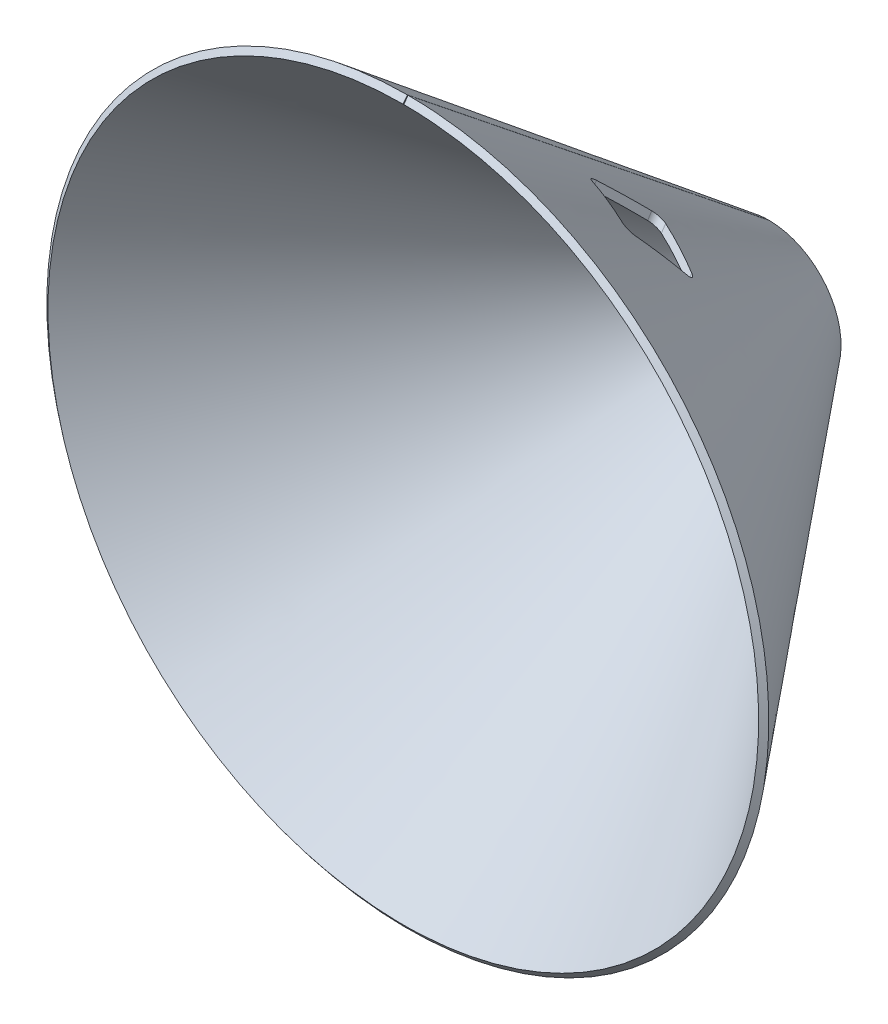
ISO-10303-21;
HEADER;
FILE_DESCRIPTION(('STEP AP214'),'2;1');
FILE_NAME('part.step','',(''),(''),'','','');
FILE_SCHEMA(('AUTOMOTIVE_DESIGN { 1 0 10303 214 1 1 1 1 }'));
ENDSEC;
DATA;
#1=APPLICATION_CONTEXT('core data for automotive mechanical design processes');
#2=APPLICATION_PROTOCOL_DEFINITION('international standard','automotive_design',2000,#1);
#3=PRODUCT_CONTEXT('',#1,'mechanical');
#4=PRODUCT('Part','Part','',(#3));
#5=PRODUCT_RELATED_PRODUCT_CATEGORY('part','',(#4));
#6=PRODUCT_DEFINITION_FORMATION('','',#4);
#7=PRODUCT_DEFINITION_CONTEXT('part definition',#1,'design');
#8=PRODUCT_DEFINITION('design','',#6,#7);
#9=PRODUCT_DEFINITION_SHAPE('','',#8);
#10=(LENGTH_UNIT() NAMED_UNIT(*) SI_UNIT(.MILLI.,.METRE.));
#11=(NAMED_UNIT(*) PLANE_ANGLE_UNIT() SI_UNIT($,.RADIAN.));
#12=(NAMED_UNIT(*) SI_UNIT($,.STERADIAN.) SOLID_ANGLE_UNIT());
#13=UNCERTAINTY_MEASURE_WITH_UNIT(LENGTH_MEASURE(1.E-05),#10,'distance_accuracy_value','');
#14=(GEOMETRIC_REPRESENTATION_CONTEXT(3) GLOBAL_UNCERTAINTY_ASSIGNED_CONTEXT((#13)) GLOBAL_UNIT_ASSIGNED_CONTEXT((#10,
#11,#12)) REPRESENTATION_CONTEXT('',''));
#15=CARTESIAN_POINT('',(0.,0.,0.));
#16=DIRECTION('',(0.,0.,1.));
#17=DIRECTION('',(1.,0.,0.));
#18=AXIS2_PLACEMENT_3D('',#15,#16,#17);
#19=CARTESIAN_POINT('',(0.0999997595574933,19.9997499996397,0.));
#20=CARTESIAN_POINT('',(0.0999999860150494,99.9999500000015,100.));
#21=CARTESIAN_POINT('',(1.4068969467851,19.9932154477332,0.));
#22=CARTESIAN_POINT('',(6.64289768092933,99.9934070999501,100.));
#23=CARTESIAN_POINT('',(4.01914111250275,19.7209596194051,0.));
#24=CARTESIAN_POINT('',(19.7272312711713,98.6922920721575,100.));
#25=CARTESIAN_POINT('',(7.78477745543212,18.564463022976,0.));
#26=CARTESIAN_POINT('',(38.5962906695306,92.9494968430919,99.9999999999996));
#27=CARTESIAN_POINT('',(11.2496046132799,16.6893008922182,0.));
#28=CARTESIAN_POINT('',(55.9829838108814,83.6373839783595,100.));
#29=CARTESIAN_POINT('',(14.2876818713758,14.1807627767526,0.));
#30=CARTESIAN_POINT('',(71.2196862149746,71.112945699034,100.));
#31=CARTESIAN_POINT('',(16.7730685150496,11.1241382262,0.));
#32=CARTESIAN_POINT('',(83.7211958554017,55.8575267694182,100.));
#33=CARTESIAN_POINT('',(18.6220452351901,7.64552752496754,0.));
#34=CARTESIAN_POINT('',(93.0073504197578,38.4568264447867,100.));
#35=CARTESIAN_POINT('',(19.750892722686,3.87103095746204,0.));
#36=CARTESIAN_POINT('',(98.7216293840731,19.5792048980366,100.));
#37=CARTESIAN_POINT('',(20.1303895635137,-0.050375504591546,0.));
#38=CARTESIAN_POINT('',(100.644384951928,-0.0503241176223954,99.9999999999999));
#39=CARTESIAN_POINT('',(19.7313143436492,-3.9697158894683,0.));
#40=CARTESIAN_POINT('',(98.7020013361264,-19.6779119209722,99.9999999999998));
#41=CARTESIAN_POINT('',(18.5836068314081,-7.7384241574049,0.));
#42=CARTESIAN_POINT('',(92.9688455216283,-38.5498231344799,100.));
#43=CARTESIAN_POINT('',(16.7172067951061,-11.207934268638,0.));
#44=CARTESIAN_POINT('',(83.6652996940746,-55.9412045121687,99.9999999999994));
#45=CARTESIAN_POINT('',(14.2165499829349,-14.2522018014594,0.));
#46=CARTESIAN_POINT('',(71.1485316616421,-71.1841578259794,100.000000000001));
#47=CARTESIAN_POINT('',(11.1660721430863,-16.7451823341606,0.));
#48=CARTESIAN_POINT('',(55.8993293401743,-83.6932748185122,99.9999999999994));
#49=CARTESIAN_POINT('',(7.69194540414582,-18.6028679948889,0.));
#50=CARTESIAN_POINT('',(38.5033021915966,-92.9881374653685,100.000000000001));
#51=CARTESIAN_POINT('',(3.92034189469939,-19.7412509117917,0.));
#52=CARTESIAN_POINT('',(19.6285665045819,-98.7117973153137,99.9999999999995));
#53=CARTESIAN_POINT('',(0.,-20.1306166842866,0.));
#54=CARTESIAN_POINT('',(-1.73472347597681E-13,-100.644407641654,100.));
#55=CARTESIAN_POINT('',(-3.92034189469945,-19.7412509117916,0.));
#56=CARTESIAN_POINT('',(-19.6285665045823,-98.7117973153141,99.9999999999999));
#57=CARTESIAN_POINT('',(-7.69194540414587,-18.6028679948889,0.));
#58=CARTESIAN_POINT('',(-38.5033021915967,-92.9881374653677,99.9999999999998));
#59=CARTESIAN_POINT('',(-11.1660721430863,-16.7451823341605,0.));
#60=CARTESIAN_POINT('',(-55.8993293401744,-83.6932748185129,100.));
#61=CARTESIAN_POINT('',(-14.216549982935,-14.2522018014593,0.));
#62=CARTESIAN_POINT('',(-71.1485316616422,-71.1841578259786,99.9999999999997));
#63=CARTESIAN_POINT('',(-16.7172067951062,-11.207934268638,0.));
#64=CARTESIAN_POINT('',(-83.6652996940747,-55.9412045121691,100.));
#65=CARTESIAN_POINT('',(-18.5836068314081,-7.73842415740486,0.));
#66=CARTESIAN_POINT('',(-92.9688455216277,-38.5498231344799,99.9999999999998));
#67=CARTESIAN_POINT('',(-19.7313143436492,-3.96971588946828,0.));
#68=CARTESIAN_POINT('',(-98.7020013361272,-19.6779119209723,100.));
#69=CARTESIAN_POINT('',(-20.1303895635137,-0.0503755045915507,0.));
#70=CARTESIAN_POINT('',(-100.644384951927,-0.0503241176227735,99.9999999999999));
#71=CARTESIAN_POINT('',(-19.750892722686,3.87103095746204,0.));
#72=CARTESIAN_POINT('',(-98.7216293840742,19.5792048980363,100.));
#73=CARTESIAN_POINT('',(-18.62204523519,7.64552752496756,0.));
#74=CARTESIAN_POINT('',(-93.007350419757,38.4568264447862,99.9999999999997));
#75=CARTESIAN_POINT('',(-16.7730685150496,11.1241382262,0.));
#76=CARTESIAN_POINT('',(-83.7211958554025,55.8575267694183,100.));
#77=CARTESIAN_POINT('',(-14.2876818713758,14.1807627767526,0.));
#78=CARTESIAN_POINT('',(-71.2196862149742,71.1129456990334,99.9999999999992));
#79=CARTESIAN_POINT('',(-11.2496046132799,16.6893008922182,0.));
#80=CARTESIAN_POINT('',(-55.9829838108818,83.6373839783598,100.000000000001));
#81=CARTESIAN_POINT('',(-7.78477745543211,18.564463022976,0.));
#82=CARTESIAN_POINT('',(-38.5962906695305,92.9494968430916,99.9999999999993));
#83=CARTESIAN_POINT('',(-4.01914111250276,19.7209596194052,0.));
#84=CARTESIAN_POINT('',(-19.7272312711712,98.6922920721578,100.000000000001));
#85=CARTESIAN_POINT('',(-1.4068969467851,19.9932154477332,0.));
#86=CARTESIAN_POINT('',(-6.64289768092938,99.9934070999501,100.));
#87=CARTESIAN_POINT('',(-0.0999997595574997,19.9997499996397,0.));
#88=CARTESIAN_POINT('',(-0.0999999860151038,99.9999500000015,100.));
#89=B_SPLINE_SURFACE_WITH_KNOTS('',3,1,((#19,#20),(#21,#22),(#23,#24),(#25,#26),(#27,#28),(#29,
#30),(#31,#32),(#33,#34),(#35,#36),(#37,#38),(#39,#40),(#41,#42),(#43,#44),(#45,#46),(#47,#48),
(#49,#50),(#51,#52),(#53,#54),(#55,#56),(#57,#58),(#59,#60),(#61,#62),(#63,#64),(#65,#66),(#67,
#68),(#69,#70),(#71,#72),(#73,#74),(#75,#76),(#77,#78),(#79,#80),(#81,#82),(#83,#84),(#85,#86),
(#87,#88)),.UNSPECIFIED.,.F.,.F.,.F.,(4,1,1,1,1,1,1,1,1,1,1,1,1,1,1,1,1,1,1,1,1,1,1,1,1,1,1,1,1,
1,1,1,4),(2,2),(0.,0.03125,0.0625,0.09375,0.125,0.15625,0.1875,0.21875,0.25,0.28125,0.3125,
0.34375,0.375,0.40625,0.4375,0.46875,0.5,0.53125,0.5625,0.59375,0.625,0.65625,0.6875,0.71875,
0.75,0.78125,0.8125,0.84375,0.875,0.90625,0.9375,0.96875,1.),(0.,1.),.UNSPECIFIED.);
#90=OFFSET_SURFACE('',#89,2.,.F.);
#91=CARTESIAN_POINT('',(0.0921910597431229,18.4380258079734,1.24938247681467));
#92=CARTESIAN_POINT('',(0.393212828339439,18.4365196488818,1.24938154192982));
#93=CARTESIAN_POINT('',(0.694190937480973,18.4275494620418,1.24938120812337));
#94=CARTESIAN_POINT('',(1.29552562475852,18.3948217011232,1.24938184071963));
#95=CARTESIAN_POINT('',(1.5958817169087,18.371055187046,1.24938280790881));
#96=CARTESIAN_POINT('',(2.19519846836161,18.3088645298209,1.2493861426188));
#97=CARTESIAN_POINT('',(2.49415848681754,18.2704342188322,1.24938851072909));
#98=CARTESIAN_POINT('',(3.08991059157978,18.179052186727,1.24939280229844));
#99=CARTESIAN_POINT('',(3.38670224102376,18.1260976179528,1.24939472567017));
#100=CARTESIAN_POINT('',(3.97734275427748,18.0058113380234,1.24939498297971));
#101=CARTESIAN_POINT('',(4.27119175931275,17.9384803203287,1.24939331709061));
#102=CARTESIAN_POINT('',(4.85517511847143,17.7895990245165,1.24938935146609));
#103=CARTESIAN_POINT('',(5.14531052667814,17.7080528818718,1.24938705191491));
#104=CARTESIAN_POINT('',(5.72109841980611,17.5309067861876,1.24938339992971));
#105=CARTESIAN_POINT('',(6.00675310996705,17.4353140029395,1.24938204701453));
#106=CARTESIAN_POINT('',(6.57281796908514,17.2302461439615,1.2493801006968));
#107=CARTESIAN_POINT('',(6.85323157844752,17.1207805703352,1.24937950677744));
#108=CARTESIAN_POINT('',(7.40828396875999,16.8880516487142,1.2493781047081));
#109=CARTESIAN_POINT('',(7.68292256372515,16.7647878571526,1.24937729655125));
#110=CARTESIAN_POINT('',(8.22599749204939,16.5048024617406,1.2493775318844));
#111=CARTESIAN_POINT('',(8.49442915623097,16.3680711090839,1.24937857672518));
#112=CARTESIAN_POINT('',(9.02442497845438,16.0815700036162,1.24938211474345));
#113=CARTESIAN_POINT('',(9.28598541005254,15.9317933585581,1.24938460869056));
#114=CARTESIAN_POINT('',(9.80157236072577,15.6196298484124,1.24938934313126));
#115=CARTESIAN_POINT('',(10.0555966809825,15.4572393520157,1.24939158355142));
#116=CARTESIAN_POINT('',(10.5554469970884,15.1202841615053,1.24939262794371));
#117=CARTESIAN_POINT('',(10.8012728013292,14.9457191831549,1.24939143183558));
#118=CARTESIAN_POINT('',(11.2840691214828,14.5848629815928,1.24938846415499));
#119=CARTESIAN_POINT('',(11.5210417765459,14.3985746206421,1.24938669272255));
#120=CARTESIAN_POINT('',(11.9854810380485,14.0147255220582,1.24938405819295));
#121=CARTESIAN_POINT('',(12.2129522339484,13.8171703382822,1.24938319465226));
#122=CARTESIAN_POINT('',(12.6577462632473,13.4112449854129,1.24938215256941));
#123=CARTESIAN_POINT('',(12.8750760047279,13.2028823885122,1.24938197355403));
#124=CARTESIAN_POINT('',(13.2991227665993,12.7756334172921,1.24938119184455));
#125=CARTESIAN_POINT('',(13.5058400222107,12.5567472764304,1.24938058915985));
#126=CARTESIAN_POINT('',(13.9083922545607,12.10892955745,1.24938099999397));
#127=CARTESIAN_POINT('',(14.1042199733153,11.8799914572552,1.24938201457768));
#128=CARTESIAN_POINT('',(14.4845402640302,11.4127075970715,1.24938536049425));
#129=CARTESIAN_POINT('',(14.6690274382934,11.1743574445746,1.24938769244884));
#130=CARTESIAN_POINT('',(15.0262160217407,10.6888955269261,1.24939204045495));
#131=CARTESIAN_POINT('',(15.1989145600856,10.4417816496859,1.24939405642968));
#132=CARTESIAN_POINT('',(15.5320800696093,9.93944462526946,1.2493946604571));
#133=CARTESIAN_POINT('',(15.6925471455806,9.68422154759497,1.24939324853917));
#134=CARTESIAN_POINT('',(16.0008152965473,9.16632643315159,1.24938989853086));
#135=CARTESIAN_POINT('',(16.1486196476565,8.90365634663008,1.24938796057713));
#136=CARTESIAN_POINT('',(16.4311358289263,8.37153043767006,1.24938506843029));
#137=CARTESIAN_POINT('',(16.5658540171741,8.10207799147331,1.24938411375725));
#138=CARTESIAN_POINT('',(16.8217804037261,7.55705043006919,1.24938301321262));
#139=CARTESIAN_POINT('',(16.9429976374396,7.28147955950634,1.2493828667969));
#140=CARTESIAN_POINT('',(17.1716055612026,6.72465625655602,1.24938219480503));
#141=CARTESIAN_POINT('',(17.2789960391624,6.44340373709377,1.24938166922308));
#142=CARTESIAN_POINT('',(17.4798846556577,5.87576218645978,1.2493821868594));
#143=CARTESIAN_POINT('',(17.5733730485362,5.58936970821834,1.24938323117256));
#144=CARTESIAN_POINT('',(17.7462819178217,5.01221334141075,1.24938661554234));
#145=CARTESIAN_POINT('',(17.8256953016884,4.72144732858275,1.2493889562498));
#146=CARTESIAN_POINT('',(17.9702838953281,4.13631585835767,1.24939329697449));
#147=CARTESIAN_POINT('',(18.0354553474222,3.84194947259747,1.24939529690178));
#148=CARTESIAN_POINT('',(18.1513967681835,3.25039325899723,1.24939585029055));
#149=CARTESIAN_POINT('',(18.2021666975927,2.95320342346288,1.24939440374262));
#150=CARTESIAN_POINT('',(18.2891554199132,2.35677938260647,1.24939098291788));
#151=CARTESIAN_POINT('',(18.3253779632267,2.05754572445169,1.24938900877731));
#152=CARTESIAN_POINT('',(18.3831307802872,1.45781281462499,1.24938605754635));
#153=CARTESIAN_POINT('',(18.4046683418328,1.15731426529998,1.24938507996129));
#154=CARTESIAN_POINT('',(18.4329185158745,0.555826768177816,1.24938399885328));
#155=CARTESIAN_POINT('',(18.4396413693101,0.254838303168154,1.24938389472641));
#156=CARTESIAN_POINT('',(18.4381378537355,-0.347098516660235,1.24938330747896));
#157=CARTESIAN_POINT('',(18.4299116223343,-0.648046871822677,1.24938282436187));
#158=CARTESIAN_POINT('',(18.3986575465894,-1.24937583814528,1.249383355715));
#159=CARTESIAN_POINT('',(18.3756196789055,-1.54975592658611,1.24938437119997));
#160=CARTESIAN_POINT('',(18.3148727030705,-2.1491759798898,1.2493876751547));
#161=CARTESIAN_POINT('',(18.2771564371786,-2.44821521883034,1.24938996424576));
#162=CARTESIAN_POINT('',(18.1871904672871,-3.04417688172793,1.24939419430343));
#163=CARTESIAN_POINT('',(18.1349370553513,-3.34109874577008,1.24939613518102));
#164=CARTESIAN_POINT('',(18.0160425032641,-3.93204788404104,1.24939658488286));
#165=CARTESIAN_POINT('',(17.9494013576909,-4.22607515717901,1.24939509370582));
#166=CARTESIAN_POINT('',(17.8018907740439,-4.81045970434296,1.24939161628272));
#167=CARTESIAN_POINT('',(17.7210249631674,-5.10081789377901,1.24938963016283));
#168=CARTESIAN_POINT('',(17.5452321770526,-5.67709236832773,1.24938669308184));
#169=CARTESIAN_POINT('',(17.450312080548,-5.96301075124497,1.24938574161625));
#170=CARTESIAN_POINT('',(17.2465842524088,-6.52964021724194,1.24938478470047));
#171=CARTESIAN_POINT('',(17.1377859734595,-6.81035469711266,1.24938477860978));
#172=CARTESIAN_POINT('',(16.9063899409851,-7.36603907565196,1.2493843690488));
#173=CARTESIAN_POINT('',(16.7837921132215,-7.6410089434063,1.24938396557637));
#174=CARTESIAN_POINT('',(16.5251351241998,-8.18477130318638,1.24938456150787));
#175=CARTESIAN_POINT('',(16.3890667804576,-8.45355942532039,1.24938556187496));
#176=CARTESIAN_POINT('',(16.1038844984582,-8.98429312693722,1.24938878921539));
#177=CARTESIAN_POINT('',(15.9547641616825,-9.24623526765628,1.24939101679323));
#178=CARTESIAN_POINT('',(15.6439021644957,-9.76261072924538,1.24939509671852));
#179=CARTESIAN_POINT('',(15.4821572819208,-10.0170421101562,1.24939694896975));
#180=CARTESIAN_POINT('',(15.1464782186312,-10.5177318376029,1.2493972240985));
#181=CARTESIAN_POINT('',(14.9725440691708,-10.7639902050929,1.24939564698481));
#182=CARTESIAN_POINT('',(14.6129302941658,-11.247677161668,1.24939202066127));
#183=CARTESIAN_POINT('',(14.4272537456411,-11.4851080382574,1.24938997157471));
#184=CARTESIAN_POINT('',(14.0446047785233,-11.9504894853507,1.24938694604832));
#185=CARTESIAN_POINT('',(13.8476380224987,-12.1784447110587,1.24938596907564));
#186=CARTESIAN_POINT('',(13.4428617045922,-12.6242328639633,1.24938504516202));
#187=CARTESIAN_POINT('',(13.2350597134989,-12.8420726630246,1.24938509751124));
#188=CARTESIAN_POINT('',(12.8088988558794,-13.2671671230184,1.24938481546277));
#189=CARTESIAN_POINT('',(12.5905400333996,-13.4744218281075,1.24938448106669));
#190=CARTESIAN_POINT('',(12.1437425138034,-13.8780771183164,1.24938515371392));
#191=CARTESIAN_POINT('',(11.9152970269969,-14.0744701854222,1.24938616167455));
#192=CARTESIAN_POINT('',(11.4489642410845,-14.4559475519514,1.24938938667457));
#193=CARTESIAN_POINT('',(11.2110723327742,-14.6410262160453,1.24939160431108));
#194=CARTESIAN_POINT('',(10.7264930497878,-14.9994222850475,1.24939565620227));
#195=CARTESIAN_POINT('',(10.4798034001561,-15.1727366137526,1.24939749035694));
#196=CARTESIAN_POINT('',(9.97828136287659,-15.5071563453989,1.24939773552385));
#197=CARTESIAN_POINT('',(9.72344893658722,-15.6682616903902,1.24939614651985));
#198=CARTESIAN_POINT('',(9.20630212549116,-15.9778271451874,1.24939251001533));
#199=CARTESIAN_POINT('',(8.94398963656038,-16.1262904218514,1.24939046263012));
#200=CARTESIAN_POINT('',(8.41254645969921,-16.4101433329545,1.24938745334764));
#201=CARTESIAN_POINT('',(8.14341914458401,-16.5455392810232,1.24938649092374));
#202=CARTESIAN_POINT('',(7.5990100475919,-16.8028383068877,1.24938564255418));
#203=CARTESIAN_POINT('',(7.32373255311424,-16.9247504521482,1.24938575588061));
#204=CARTESIAN_POINT('',(6.76746581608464,-17.1547634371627,1.24938555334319));
#205=CARTESIAN_POINT('',(6.48647655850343,-17.2628642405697,1.24938523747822));
#206=CARTESIAN_POINT('',(5.91933175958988,-17.4651860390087,1.24938583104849));
#207=CARTESIAN_POINT('',(5.63317283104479,-17.5593975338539,1.24938674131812));
#208=CARTESIAN_POINT('',(5.05645258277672,-17.7337630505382,1.24938971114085));
#209=CARTESIAN_POINT('',(4.76588918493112,-17.8139101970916,1.249391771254));
#210=CARTESIAN_POINT('',(4.18113065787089,-17.9599745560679,1.24939547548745));
#211=CARTESIAN_POINT('',(3.88693463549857,-18.0258881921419,1.24939711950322));
#212=CARTESIAN_POINT('',(3.29568552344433,-18.1433200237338,1.24939698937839));
#213=CARTESIAN_POINT('',(2.99863245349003,-18.1948383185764,1.24939521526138));
#214=CARTESIAN_POINT('',(2.40244694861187,-18.2833275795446,1.24939125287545));
#215=CARTESIAN_POINT('',(2.10331508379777,-18.3203023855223,1.24938906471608));
#216=CARTESIAN_POINT('',(1.50374936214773,-18.3795612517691,1.2493858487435));
#217=CARTESIAN_POINT('',(1.20331622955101,-18.4018526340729,1.24938482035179));
#218=CARTESIAN_POINT('',(0.601921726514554,-18.4316097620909,1.2493839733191));
#219=CARTESIAN_POINT('',(0.300960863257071,-18.4390857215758,1.24938415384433));
#220=CARTESIAN_POINT('',(-0.300960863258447,-18.4390857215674,1.24938415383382));
#221=CARTESIAN_POINT('',(-0.601921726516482,-18.431609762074,1.24938397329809));
#222=CARTESIAN_POINT('',(-1.20331622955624,-18.401852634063,1.24938482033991));
#223=CARTESIAN_POINT('',(-1.50374936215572,-18.3795612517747,1.24938584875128));
#224=CARTESIAN_POINT('',(-2.10331508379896,-18.3203023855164,1.24938906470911));
#225=CARTESIAN_POINT('',(-2.40244694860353,-18.2833275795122,1.24939125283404));
#226=CARTESIAN_POINT('',(-2.99863245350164,-18.1948383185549,1.24939521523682));
#227=CARTESIAN_POINT('',(-3.2956855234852,-18.1433200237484,1.24939698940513));
#228=CARTESIAN_POINT('',(-3.88693463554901,-18.0258881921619,1.24939711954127));
#229=CARTESIAN_POINT('',(-4.18113065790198,-17.9599745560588,1.24939547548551));
#230=CARTESIAN_POINT('',(-4.76588918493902,-17.8139101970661,1.24939177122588));
#231=CARTESIAN_POINT('',(-5.0564525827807,-17.733763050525,1.24938971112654));
#232=CARTESIAN_POINT('',(-5.63317283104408,-17.559397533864,1.24938674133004));
#233=CARTESIAN_POINT('',(-5.91933175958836,-17.4651860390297,1.24938583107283));
#234=CARTESIAN_POINT('',(-6.48647655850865,-17.2628642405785,1.24938523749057));
#235=CARTESIAN_POINT('',(-6.76746581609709,-17.1547634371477,1.24938555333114));
#236=CARTESIAN_POINT('',(-7.32373255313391,-16.9247504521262,1.24938575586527));
#237=CARTESIAN_POINT('',(-7.59901004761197,-16.8028383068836,1.24938564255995));
#238=CARTESIAN_POINT('',(-8.14341914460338,-16.5455392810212,1.24938649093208));
#239=CARTESIAN_POINT('',(-8.41254645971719,-16.4101433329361,1.24938745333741));
#240=CARTESIAN_POINT('',(-8.94398963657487,-16.1262904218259,1.24939046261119));
#241=CARTESIAN_POINT('',(-9.20630212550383,-15.9778271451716,1.24939251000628));
#242=CARTESIAN_POINT('',(-9.72344893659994,-15.6682616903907,1.24939614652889));
#243=CARTESIAN_POINT('',(-9.97828136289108,-15.5071563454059,1.24939773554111));
#244=CARTESIAN_POINT('',(-10.4798034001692,-15.1727366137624,1.24939749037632));
#245=CARTESIAN_POINT('',(-10.7264930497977,-14.9994222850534,1.24939565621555));
#246=CARTESIAN_POINT('',(-11.211072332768,-14.6410262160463,1.24939160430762));
#247=CARTESIAN_POINT('',(-11.4489642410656,-14.4559475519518,1.24938938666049));
#248=CARTESIAN_POINT('',(-11.9152970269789,-14.074470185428,1.24938616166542));
#249=CARTESIAN_POINT('',(-12.1437425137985,-13.8780771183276,1.24938515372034));
#250=CARTESIAN_POINT('',(-12.5905400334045,-13.4744218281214,1.24938448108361));
#251=CARTESIAN_POINT('',(-12.8088988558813,-13.2671671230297,1.24938481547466));
#252=CARTESIAN_POINT('',(-13.235059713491,-12.8420726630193,1.24938509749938));
#253=CARTESIAN_POINT('',(-13.4428617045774,-12.6242328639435,1.24938504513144));
#254=CARTESIAN_POINT('',(-13.847638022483,-12.178444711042,1.24938596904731));
#255=CARTESIAN_POINT('',(-14.0446047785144,-11.9504894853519,1.249386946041));
#256=CARTESIAN_POINT('',(-14.4272537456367,-11.4851080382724,1.24938997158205));
#257=CARTESIAN_POINT('',(-14.6129302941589,-11.2476771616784,1.24939202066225));
#258=CARTESIAN_POINT('',(-14.9725440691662,-10.763990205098,1.24939564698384));
#259=CARTESIAN_POINT('',(-15.1464782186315,-10.5177318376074,1.24939722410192));
#260=CARTESIAN_POINT('',(-15.4821572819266,-10.0170421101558,1.24939694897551));
#261=CARTESIAN_POINT('',(-15.643902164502,-9.76261072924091,1.24939509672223));
#262=CARTESIAN_POINT('',(-15.9547641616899,-9.2462352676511,1.24939101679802));
#263=CARTESIAN_POINT('',(-16.1038844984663,-8.98429312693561,1.24938878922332));
#264=CARTESIAN_POINT('',(-16.3890667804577,-8.45355942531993,1.24938556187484));
#265=CARTESIAN_POINT('',(-16.5251351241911,-8.18477130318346,1.24938456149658));
#266=CARTESIAN_POINT('',(-16.7837921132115,-7.641008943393,1.24938396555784));
#267=CARTESIAN_POINT('',(-16.9063899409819,-7.36603907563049,1.24938436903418));
#268=CARTESIAN_POINT('',(-17.1377859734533,-6.81035469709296,1.24938477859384));
#269=CARTESIAN_POINT('',(-17.246584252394,-6.52964021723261,1.24938478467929));
#270=CARTESIAN_POINT('',(-17.450312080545,-5.9630107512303,1.24938574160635));
#271=CARTESIAN_POINT('',(-17.5452321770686,-5.67709236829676,1.24938669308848));
#272=CARTESIAN_POINT('',(-17.7210249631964,-5.10081789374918,1.24938963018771));
#273=CARTESIAN_POINT('',(-17.8018907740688,-4.81045970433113,1.24939161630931));
#274=CARTESIAN_POINT('',(-17.9494013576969,-4.22607515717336,1.24939509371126));
#275=CARTESIAN_POINT('',(-18.0160425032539,-3.93204788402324,1.24939658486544));
#276=CARTESIAN_POINT('',(-18.1349370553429,-3.34109874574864,1.24939613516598));
#277=CARTESIAN_POINT('',(-18.1871904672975,-3.04417688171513,1.24939419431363));
#278=CARTESIAN_POINT('',(-18.277156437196,-2.44821521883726,1.24938996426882));
#279=CARTESIAN_POINT('',(-18.3148727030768,-2.14917597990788,1.24938767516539));
#280=CARTESIAN_POINT('',(-18.375619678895,-1.54975592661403,1.24938437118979));
#281=CARTESIAN_POINT('',(-18.3986575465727,-1.24937583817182,1.24938335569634));
#282=CARTESIAN_POINT('',(-18.4299116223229,-0.648046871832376,1.24938282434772));
#283=CARTESIAN_POINT('',(-18.4381378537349,-0.347098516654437,1.2493833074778));
#284=CARTESIAN_POINT('',(-18.4396413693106,0.254838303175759,1.24938389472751));
#285=CARTESIAN_POINT('',(-18.4329185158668,0.555826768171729,1.24938399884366));
#286=CARTESIAN_POINT('',(-18.4046683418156,1.15731426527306,1.24938507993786));
#287=CARTESIAN_POINT('',(-18.3831307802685,1.45781281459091,1.24938605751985));
#288=CARTESIAN_POINT('',(-18.3253779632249,2.05754572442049,1.24938900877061));
#289=CARTESIAN_POINT('',(-18.2891554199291,2.35677938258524,1.24939098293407));
#290=CARTESIAN_POINT('',(-18.2021666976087,2.95320342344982,1.24939440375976));
#291=CARTESIAN_POINT('',(-18.1513967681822,3.25039325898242,1.24939585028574));
#292=CARTESIAN_POINT('',(-18.0354553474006,3.84194947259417,1.24939529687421));
#293=CARTESIAN_POINT('',(-17.9702838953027,4.1363158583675,1.2493932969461));
#294=CARTESIAN_POINT('',(-17.8256953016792,4.72144732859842,1.24938895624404));
#295=CARTESIAN_POINT('',(-17.7462819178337,5.01221334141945,1.24938661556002));
#296=CARTESIAN_POINT('',(-17.5733730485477,5.58936970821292,1.24938323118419));
#297=CARTESIAN_POINT('',(-17.4798846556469,5.87576218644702,1.24938218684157));
#298=CARTESIAN_POINT('',(-17.2789960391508,6.44340373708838,1.24938166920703));
#299=CARTESIAN_POINT('',(-17.1716055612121,6.72465625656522,1.24938219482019));
#300=CARTESIAN_POINT('',(-16.9429976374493,7.28147955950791,1.24938286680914));
#301=CARTESIAN_POINT('',(-16.8217804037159,7.5570504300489,1.24938301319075));
#302=CARTESIAN_POINT('',(-16.5658540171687,8.10207799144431,1.24938411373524));
#303=CARTESIAN_POINT('',(-16.4311358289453,8.37153043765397,1.24938506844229));
#304=CARTESIAN_POINT('',(-16.1486196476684,8.90365634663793,1.24938796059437));
#305=CARTESIAN_POINT('',(-16.0008152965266,9.16632643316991,1.24938989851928));
#306=CARTESIAN_POINT('',(-15.6925471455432,9.68422154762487,1.24939324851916));
#307=CARTESIAN_POINT('',(-15.5320800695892,9.9394446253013,1.24939466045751));
#308=CARTESIAN_POINT('',(-15.1989145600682,10.4417816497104,1.24939405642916));
#309=CARTESIAN_POINT('',(-15.0262160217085,10.6888955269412,1.24939204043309));
#310=CARTESIAN_POINT('',(-14.6690274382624,11.1743574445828,1.24938769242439));
#311=CARTESIAN_POINT('',(-14.4845402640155,11.4127075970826,1.24938536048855));
#312=CARTESIAN_POINT('',(-14.1042199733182,11.8799914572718,1.24938201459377));
#313=CARTESIAN_POINT('',(-13.9083922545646,12.1089295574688,1.24938100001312));
#314=CARTESIAN_POINT('',(-13.5058400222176,12.5567472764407,1.24938058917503));
#315=CARTESIAN_POINT('',(-13.2991227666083,12.7756334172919,1.24938119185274));
#316=CARTESIAN_POINT('',(-12.8750760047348,13.2028823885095,1.24938197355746));
#317=CARTESIAN_POINT('',(-12.6577462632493,13.4112449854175,1.24938215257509));
#318=CARTESIAN_POINT('',(-12.2129522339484,13.817170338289,1.24938319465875));
#319=CARTESIAN_POINT('',(-11.9854810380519,14.0147255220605,1.24938405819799));
#320=CARTESIAN_POINT('',(-11.5210417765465,14.3985746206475,1.24938669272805));
#321=CARTESIAN_POINT('',(-11.2840691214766,14.5848629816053,1.24938846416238));
#322=CARTESIAN_POINT('',(-10.8012728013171,14.945719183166,1.24939143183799));
#323=CARTESIAN_POINT('',(-10.5554469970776,15.1202841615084,1.24939262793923));
#324=CARTESIAN_POINT('',(-10.055596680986,15.4572393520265,1.2493915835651));
#325=CARTESIAN_POINT('',(-9.80157236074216,15.6196298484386,1.24938934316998));
#326=CARTESIAN_POINT('',(-9.28598541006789,15.9317933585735,1.24938460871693));
#327=CARTESIAN_POINT('',(-9.02442497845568,16.0815700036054,1.24938211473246));
#328=CARTESIAN_POINT('',(-8.49442915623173,16.3680711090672,1.24937857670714));
#329=CARTESIAN_POINT('',(-8.22599749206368,16.5048024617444,1.24937753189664));
#330=CARTESIAN_POINT('',(-7.68292256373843,16.7647878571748,1.24937729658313));
#331=CARTESIAN_POINT('',(-7.40828396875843,16.8880516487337,1.24937810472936));
#332=CARTESIAN_POINT('',(-6.85323157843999,17.1207805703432,1.24937950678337));
#333=CARTESIAN_POINT('',(-6.57281796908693,17.2302461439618,1.24938010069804));
#334=CARTESIAN_POINT('',(-6.0067531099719,17.435314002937,1.24938204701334));
#335=CARTESIAN_POINT('',(-5.72109841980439,17.5309067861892,1.24938339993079));
#336=CARTESIAN_POINT('',(-5.14531052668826,17.7080528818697,1.24938705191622));
#337=CARTESIAN_POINT('',(-4.85517511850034,17.7895990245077,1.24938935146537));
#338=CARTESIAN_POINT('',(-4.271191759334,17.9384803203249,1.24939331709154));
#339=CARTESIAN_POINT('',(-3.97734275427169,18.0058113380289,1.24939498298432));
#340=CARTESIAN_POINT('',(-3.38670224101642,18.1260976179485,1.24939472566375));
#341=CARTESIAN_POINT('',(-3.08991059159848,18.1790521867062,1.24939280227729));
#342=CARTESIAN_POINT('',(-2.49415848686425,18.2704342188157,1.24938851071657));
#343=CARTESIAN_POINT('',(-2.19519846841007,18.3088645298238,1.24938614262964));
#344=CARTESIAN_POINT('',(-1.595881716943,18.3710551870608,1.24938280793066));
#345=CARTESIAN_POINT('',(-1.29552562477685,18.3948217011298,1.24938184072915));
#346=CARTESIAN_POINT('',(-0.694190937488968,18.4275494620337,1.24938120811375));
#347=CARTESIAN_POINT('',(-0.393212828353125,18.4365196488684,1.24938154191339));
#348=CARTESIAN_POINT('',(-0.0921910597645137,18.4380258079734,1.24938247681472));
#349=B_SPLINE_CURVE_WITH_KNOTS('',3,(#91,#92,#93,#94,#95,#96,#97,#98,#99,#100,#101,#102,#103,
#104,#105,#106,#107,#108,#109,#110,#111,#112,#113,#114,#115,#116,#117,#118,#119,#120,#121,#122,
#123,#124,#125,#126,#127,#128,#129,#130,#131,#132,#133,#134,#135,#136,#137,#138,#139,#140,#141,
#142,#143,#144,#145,#146,#147,#148,#149,#150,#151,#152,#153,#154,#155,#156,#157,#158,#159,#160,
#161,#162,#163,#164,#165,#166,#167,#168,#169,#170,#171,#172,#173,#174,#175,#176,#177,#178,#179,
#180,#181,#182,#183,#184,#185,#186,#187,#188,#189,#190,#191,#192,#193,#194,#195,#196,#197,#198,
#199,#200,#201,#202,#203,#204,#205,#206,#207,#208,#209,#210,#211,#212,#213,#214,#215,#216,#217,
#218,#219,#220,#221,#222,#223,#224,#225,#226,#227,#228,#229,#230,#231,#232,#233,#234,#235,#236,
#237,#238,#239,#240,#241,#242,#243,#244,#245,#246,#247,#248,#249,#250,#251,#252,#253,#254,#255,
#256,#257,#258,#259,#260,#261,#262,#263,#264,#265,#266,#267,#268,#269,#270,#271,#272,#273,#274,
#275,#276,#277,#278,#279,#280,#281,#282,#283,#284,#285,#286,#287,#288,#289,#290,#291,#292,#293,
#294,#295,#296,#297,#298,#299,#300,#301,#302,#303,#304,#305,#306,#307,#308,#309,#310,#311,#312,
#313,#314,#315,#316,#317,#318,#319,#320,#321,#322,#323,#324,#325,#326,#327,#328,#329,#330,#331,
#332,#333,#334,#335,#336,#337,#338,#339,#340,#341,#342,#343,#344,#345,#346,#347,#348),
.UNSPECIFIED.,.F.,.F.,(4,2,2,2,2,2,2,2,2,2,2,2,2,2,2,2,2,2,2,2,2,2,2,2,2,2,2,2,2,2,2,2,2,2,2,2,
2,2,2,2,2,2,2,2,2,2,2,2,2,2,2,2,2,2,2,2,2,2,2,2,2,2,2,2,2,2,2,2,2,2,2,2,2,2,2,2,2,2,2,2,2,2,2,2,
2,2,2,2,2,2,2,2,2,2,2,2,2,2,2,2,2,2,2,2,2,2,2,2,2,2,2,2,2,2,2,2,2,2,2,2,2,2,2,2,2,2,2,2,4),(0.,
0.902975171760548,1.80649645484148,2.71039819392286,3.61447728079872,4.51851276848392,
5.42228569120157,6.32559889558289,7.22829669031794,8.13102351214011,9.03440866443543,
9.93827403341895,10.8424005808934,11.7465482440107,12.6504760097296,13.5539619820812,
14.4568232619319,15.3596645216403,16.2631004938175,17.1669631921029,18.0710452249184,
18.9751195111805,19.8789591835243,20.782357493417,21.6851475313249,22.587951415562,
23.4913852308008,24.395273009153,25.2993989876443,26.2035274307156,27.1074226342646,
28.010868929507,28.9136905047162,29.8165037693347,30.7199286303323,31.6237945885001,
32.5278913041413,33.4319883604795,34.3358552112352,35.2392811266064,36.142094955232,
37.0449136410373,37.9483520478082,38.8522358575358,39.7563511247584,40.6604640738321,
41.5643410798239,42.4677686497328,43.3705732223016,44.273374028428,45.1767920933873,
46.0806565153,46.9847563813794,47.8888605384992,48.7927375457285,49.6961756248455,
50.5990024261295,51.5018316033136,52.4052754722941,53.3091597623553,54.2132709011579,
55.1173758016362,56.021241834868,56.9246568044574,57.8274487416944,58.7302406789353,
59.633655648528,60.5375216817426,61.4416265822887,62.3457377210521,63.2496220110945,
64.1530658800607,65.0558950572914,65.958721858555,66.8621599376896,67.7660369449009,
68.6701411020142,69.5742409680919,70.4781053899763,71.3815234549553,72.2843242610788,
73.1871288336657,74.090556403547,74.9944334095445,75.8985463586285,76.8026616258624,
77.7065454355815,78.6099838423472,79.5128025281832,80.4156163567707,81.3190422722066,
82.2229091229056,83.1270061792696,84.0311028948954,84.9349688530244,85.8383937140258,
86.7412069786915,87.6440285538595,88.5474748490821,89.4513700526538,90.3554984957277,
91.2596244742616,92.1635122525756,93.0669460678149,93.9697499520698,94.8725399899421,
95.775938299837,96.6797779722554,97.5838522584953,98.4879342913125,99.3917969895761,
100.295232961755,101.198074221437,102.100935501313,103.004421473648,103.908349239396,
104.812496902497,105.716623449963,106.620488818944,107.523873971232,108.42660079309,
109.329298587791,110.232611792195,111.136384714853,112.040420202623,112.944499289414,
113.848401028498,114.751922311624,115.654897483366),.UNSPECIFIED.);
#350=CARTESIAN_POINT('',(0.0921910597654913,18.4380258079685,1.24938247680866));
#351=VERTEX_POINT('',#350);
#352=CARTESIAN_POINT('',(-0.0921910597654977,18.4380258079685,1.24938247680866));
#353=VERTEX_POINT('',#352);
#354=EDGE_CURVE('E170',#351,#353,#349,.T.);
#355=ORIENTED_EDGE('',*,*,#354,.T.);
#356=CARTESIAN_POINT('',(-0.0921910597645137,18.4380258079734,1.24938247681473));
#357=CARTESIAN_POINT('',(-0.0933780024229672,21.771364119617,5.41605177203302));
#358=CARTESIAN_POINT('',(-0.0941955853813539,25.1047037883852,9.58272004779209));
#359=CARTESIAN_POINT('',(-0.0953962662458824,31.7713845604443,17.9160554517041));
#360=CARTESIAN_POINT('',(-0.0957793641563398,35.104725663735,22.0827225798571));
#361=CARTESIAN_POINT('',(-0.0964153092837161,41.7714080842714,30.4160566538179));
#362=CARTESIAN_POINT('',(-0.0966681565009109,45.104749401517,34.5827235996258));
#363=CARTESIAN_POINT('',(-0.0970875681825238,51.7714322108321,42.9160573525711));
#364=CARTESIAN_POINT('',(-0.0972541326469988,55.1047737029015,47.0827241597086));
#365=CARTESIAN_POINT('',(-0.0975420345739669,61.7714567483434,55.4160577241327));
#366=CARTESIAN_POINT('',(-0.097663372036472,65.104798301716,59.5827244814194));
#367=CARTESIAN_POINT('',(-0.0978758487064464,71.7714814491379,67.9160579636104));
#368=CARTESIAN_POINT('',(-0.0979669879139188,75.1048230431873,72.0827246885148));
#369=CARTESIAN_POINT('',(-0.0981294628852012,81.7715062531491,80.4160581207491));
#370=CARTESIAN_POINT('',(-0.0982007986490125,85.1048478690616,84.5827248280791));
#371=CARTESIAN_POINT('',(-0.0983290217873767,91.7715311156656,92.9160582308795));
#372=CARTESIAN_POINT('',(-0.0983859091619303,95.1048727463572,97.08272492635));
#373=CARTESIAN_POINT('',(-0.0984382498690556,98.4382143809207,101.249391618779));
#374=B_SPLINE_CURVE_WITH_KNOTS('',3,(#356,#357,#358,#359,#360,#361,#362,#363,#364,#365,#366,
#367,#368,#369,#370,#371,#372,#373),.UNSPECIFIED.,.F.,.F.,(4,2,2,2,2,2,2,2,4),(0.,
16.0078264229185,32.0156526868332,48.0234789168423,64.0313051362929,80.0391313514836,
96.0469575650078,112.05478377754,128.06260998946),.UNSPECIFIED.);
#375=CARTESIAN_POINT('',(-0.0984382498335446,98.4382143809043,101.249391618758));
#376=VERTEX_POINT('',#375);
#377=EDGE_CURVE('E184',#353,#376,#374,.T.);
#378=ORIENTED_EDGE('',*,*,#377,.T.);
#379=CARTESIAN_POINT('',(-0.0984382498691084,98.4382143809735,101.249391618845));
#380=CARTESIAN_POINT('',(-1.70859661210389,98.4366031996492,101.249391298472));
#381=CARTESIAN_POINT('',(-3.31870412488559,98.3953706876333,101.24939130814));
#382=CARTESIAN_POINT('',(-6.53502690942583,98.2340360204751,101.249392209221));
#383=CARTESIAN_POINT('',(-8.14124202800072,98.113930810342,101.249393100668));
#384=CARTESIAN_POINT('',(-11.3458558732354,97.7952247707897,101.249395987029));
#385=CARTESIAN_POINT('',(-12.9442546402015,97.5966243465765,101.249397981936));
#386=CARTESIAN_POINT('',(-16.129321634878,97.1213061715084,101.249401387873));
#387=CARTESIAN_POINT('',(-17.7159904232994,96.8445921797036,101.24940279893));
#388=CARTESIAN_POINT('',(-20.8737918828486,96.2134123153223,101.249402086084));
#389=CARTESIAN_POINT('',(-22.4449245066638,95.8589462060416,101.24939996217));
#390=CARTESIAN_POINT('',(-25.5679964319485,95.0733934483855,101.249395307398));
#391=CARTESIAN_POINT('',(-27.1199347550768,94.6423029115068,101.24939277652));
#392=CARTESIAN_POINT('',(-30.2008464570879,93.7046487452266,101.249388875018));
#393=CARTESIAN_POINT('',(-31.7298197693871,93.1980848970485,101.249387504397));
#394=CARTESIAN_POINT('',(-34.7610311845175,92.1106371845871,101.249385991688));
#395=CARTESIAN_POINT('',(-36.2632705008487,91.5297567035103,101.249385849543));
#396=CARTESIAN_POINT('',(-39.2373491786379,90.2947941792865,101.249385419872));
#397=CARTESIAN_POINT('',(-40.7091886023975,89.6407122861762,101.249385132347));
#398=CARTESIAN_POINT('',(-43.6190959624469,88.2611604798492,101.249385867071));
#399=CARTESIAN_POINT('',(-45.0571624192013,87.5356874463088,101.249386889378));
#400=CARTESIAN_POINT('',(-47.8960489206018,86.0152035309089,101.249390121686));
#401=CARTESIAN_POINT('',(-49.296869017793,85.2201927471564,101.249392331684));
#402=CARTESIAN_POINT('',(-52.057790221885,83.5624887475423,101.249396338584));
#403=CARTESIAN_POINT('',(-53.4178932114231,82.6997986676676,101.249398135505));
#404=CARTESIAN_POINT('',(-56.0940044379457,80.9085371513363,101.249398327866));
#405=CARTESIAN_POINT('',(-57.410012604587,79.9799656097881,101.249396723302));
#406=CARTESIAN_POINT('',(-59.9949842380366,78.0593821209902,101.249393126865));
#407=CARTESIAN_POINT('',(-61.263945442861,77.0673671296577,101.249391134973));
#408=CARTESIAN_POINT('',(-63.7517761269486,75.0223951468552,101.249388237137));
#409=CARTESIAN_POINT('',(-64.9706455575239,73.9694380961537,101.249387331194));
#410=CARTESIAN_POINT('',(-67.3552491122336,71.805085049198,101.249386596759));
#411=CARTESIAN_POINT('',(-68.520985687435,70.6936917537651,101.249386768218));
#412=CARTESIAN_POINT('',(-70.7963644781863,68.4148967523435,101.249386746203));
#413=CARTESIAN_POINT('',(-71.9060067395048,67.2474950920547,101.249386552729));
#414=CARTESIAN_POINT('',(-74.0667773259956,64.8596501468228,101.249387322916));
#415=CARTESIAN_POINT('',(-75.1179029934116,63.6392044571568,101.24938828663));
#416=CARTESIAN_POINT('',(-77.1591380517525,61.1483125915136,101.249391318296));
#417=CARTESIAN_POINT('',(-78.1492474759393,59.8778664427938,101.249393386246));
#418=CARTESIAN_POINT('',(-80.0659518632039,57.2900187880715,101.249397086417));
#419=CARTESIAN_POINT('',(-80.992549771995,55.9726194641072,101.249398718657));
#420=CARTESIAN_POINT('',(-82.7798016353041,53.2938231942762,101.249398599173));
#421=CARTESIAN_POINT('',(-83.6404555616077,51.9324262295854,101.249396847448));
#422=CARTESIAN_POINT('',(-85.2940273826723,49.1690178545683,101.24939298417));
#423=CARTESIAN_POINT('',(-86.0869420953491,47.7670045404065,101.249390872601));
#424=CARTESIAN_POINT('',(-87.6031762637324,44.9258362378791,101.249387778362));
#425=CARTESIAN_POINT('',(-88.3264956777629,43.4866812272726,101.249386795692));
#426=CARTESIAN_POINT('',(-89.7016849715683,40.5747052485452,101.24938596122));
#427=CARTESIAN_POINT('',(-90.3535581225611,39.1018858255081,101.249386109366));
#428=CARTESIAN_POINT('',(-91.5840508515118,36.1259577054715,101.24938608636));
#429=CARTESIAN_POINT('',(-92.1626704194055,34.6228490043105,101.249385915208));
#430=CARTESIAN_POINT('',(-93.2455551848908,31.5900096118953,101.249386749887));
#431=CARTESIAN_POINT('',(-93.7498169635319,30.0602777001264,101.249387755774));
#432=CARTESIAN_POINT('',(-94.6828371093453,26.9779599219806,101.249390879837));
#433=CARTESIAN_POINT('',(-95.1115955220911,25.4253740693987,101.249392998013));
#434=CARTESIAN_POINT('',(-95.8924652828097,22.3011185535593,101.249396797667));
#435=CARTESIAN_POINT('',(-96.2445802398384,20.729449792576,101.249398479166));
#436=CARTESIAN_POINT('',(-96.8710495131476,17.570691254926,101.249398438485));
#437=CARTESIAN_POINT('',(-97.145403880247,15.9836014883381,101.249396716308));
#438=CARTESIAN_POINT('',(-97.6159909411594,12.7978121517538,101.249392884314));
#439=CARTESIAN_POINT('',(-97.8122200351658,11.1991120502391,101.24939077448));
#440=CARTESIAN_POINT('',(-98.1261678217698,7.99402158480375,101.24938766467));
#441=CARTESIAN_POINT('',(-98.2438865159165,6.3876312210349,101.249386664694));
#442=CARTESIAN_POINT('',(-98.4004304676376,3.17108060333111,101.249385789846));
#443=CARTESIAN_POINT('',(-98.4392593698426,1.56092052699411,101.249385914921));
#444=CARTESIAN_POINT('',(-98.4376492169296,-1.65935983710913,101.249385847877));
#445=CARTESIAN_POINT('',(-98.3972101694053,-3.26948012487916,101.249385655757));
#446=CARTESIAN_POINT('',(-98.2374497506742,-6.48587211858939,101.249386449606));
#447=CARTESIAN_POINT('',(-98.1181247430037,-8.09214364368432,101.24938743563));
#448=CARTESIAN_POINT('',(-97.800972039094,-11.296917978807,101.24939053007));
#449=CARTESIAN_POINT('',(-97.6031443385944,-12.8954207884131,101.249392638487));
#450=CARTESIAN_POINT('',(-97.1293716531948,-16.0807376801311,101.249396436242));
#451=CARTESIAN_POINT('',(-96.8534302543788,-17.6675522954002,101.249398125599));
#452=CARTESIAN_POINT('',(-96.2238023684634,-20.8256831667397,101.24939811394));
#453=CARTESIAN_POINT('',(-95.8701158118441,-22.3969994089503,101.249396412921));
#454=CARTESIAN_POINT('',(-95.0861220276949,-25.5204734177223,101.249392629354));
#455=CARTESIAN_POINT('',(-94.6558111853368,-27.0726302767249,101.249390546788));
#456=CARTESIAN_POINT('',(-93.7197091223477,-30.1540144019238,101.249387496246));
#457=CARTESIAN_POINT('',(-93.2139178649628,-31.6832416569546,101.249386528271));
#458=CARTESIAN_POINT('',(-92.1280008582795,-34.7149968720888,101.249385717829));
#459=CARTESIAN_POINT('',(-91.5478785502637,-36.2175260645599,101.24938587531));
#460=CARTESIAN_POINT('',(-90.3144107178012,-39.1922212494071,101.249385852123));
#461=CARTESIAN_POINT('',(-89.6610652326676,-40.6643872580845,101.249385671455));
#462=CARTESIAN_POINT('',(-88.2829649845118,-43.5749847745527,101.249386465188));
#463=CARTESIAN_POINT('',(-87.5582069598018,-45.0134147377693,101.249387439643));
#464=CARTESIAN_POINT('',(-86.0391326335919,-47.8530637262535,101.249390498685));
#465=CARTESIAN_POINT('',(-85.2448163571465,-49.2542827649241,101.249392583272));
#466=CARTESIAN_POINT('',(-83.588481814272,-52.0160357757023,101.249396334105));
#467=CARTESIAN_POINT('',(-82.7264666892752,-53.3765716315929,101.24939800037));
#468=CARTESIAN_POINT('',(-80.9365363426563,-56.0535809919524,101.249397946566));
#469=CARTESIAN_POINT('',(-80.0086211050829,-57.3700544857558,101.249396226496));
#470=CARTESIAN_POINT('',(-78.0893290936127,-59.9559873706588,101.249392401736));
#471=CARTESIAN_POINT('',(-77.097949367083,-61.2254445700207,101.249390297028));
#472=CARTESIAN_POINT('',(-75.0542239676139,-63.7142968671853,101.249387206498));
#473=CARTESIAN_POINT('',(-74.0018782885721,-64.9336919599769,101.249386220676));
#474=CARTESIAN_POINT('',(-71.838721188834,-67.3193755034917,101.24938538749));
#475=CARTESIAN_POINT('',(-70.7279124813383,-68.4856664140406,101.249385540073));
#476=CARTESIAN_POINT('',(-68.4502570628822,-70.7621815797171,101.249385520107));
#477=CARTESIAN_POINT('',(-67.2834103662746,-71.8724058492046,101.249385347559));
#478=CARTESIAN_POINT('',(-64.8966449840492,-74.0343671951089,101.249386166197));
#479=CARTESIAN_POINT('',(-63.6767238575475,-75.0861015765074,101.249387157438));
#480=CARTESIAN_POINT('',(-61.1868502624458,-77.1285794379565,101.249390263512));
#481=CARTESIAN_POINT('',(-59.9168978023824,-78.1193229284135,101.249392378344));
#482=CARTESIAN_POINT('',(-57.3300061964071,-80.0373194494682,101.249396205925));
#483=CARTESIAN_POINT('',(-56.0130692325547,-80.9645754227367,101.249397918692));
#484=CARTESIAN_POINT('',(-53.3351659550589,-82.7531660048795,101.249397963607));
#485=CARTESIAN_POINT('',(-51.9741996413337,-83.6145006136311,101.249396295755));
#486=CARTESIAN_POINT('',(-49.2116198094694,-85.2694540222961,101.249392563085));
#487=CARTESIAN_POINT('',(-47.81000441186,-86.0630696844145,101.249390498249));
#488=CARTESIAN_POINT('',(-44.9695979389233,-87.5807237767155,101.249387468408));
#489=CARTESIAN_POINT('',(-43.5308068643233,-88.3047622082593,101.249386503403));
#490=CARTESIAN_POINT('',(-40.6195234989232,-89.681405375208,101.249385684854));
#491=CARTESIAN_POINT('',(-39.1470327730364,-90.3340134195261,101.24938583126));
#492=CARTESIAN_POINT('',(-36.1717253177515,-91.5659897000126,101.249385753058));
#493=CARTESIAN_POINT('',(-34.6689085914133,-92.1453579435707,101.249385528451));
#494=CARTESIAN_POINT('',(-31.6366155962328,-93.2297529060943,101.249386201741));
#495=CARTESIAN_POINT('',(-30.1071380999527,-93.7347761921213,101.24938709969));
#496=CARTESIAN_POINT('',(-27.0252908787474,-94.669331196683,101.249389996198));
#497=CARTESIAN_POINT('',(-25.4729211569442,-95.098862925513,101.249391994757));
#498=CARTESIAN_POINT('',(-22.3490589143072,-95.8812901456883,101.249395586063));
#499=CARTESIAN_POINT('',(-20.7775672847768,-96.2341891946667,101.24939717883));
#500=CARTESIAN_POINT('',(-17.6191236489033,-96.8622364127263,101.249396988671));
#501=CARTESIAN_POINT('',(-16.0321716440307,-97.137384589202,101.249395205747));
#502=CARTESIAN_POINT('',(-12.8466185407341,-97.6095661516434,101.249391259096));
#503=CARTESIAN_POINT('',(-11.2480169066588,-97.806595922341,101.249389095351));
#504=CARTESIAN_POINT('',(-8.04308400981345,-98.1221490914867,101.249385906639));
#505=CARTESIAN_POINT('',(-6.43675274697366,-98.2406724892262,101.24938488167));
#506=CARTESIAN_POINT('',(-3.2202808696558,-98.3988270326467,101.249384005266));
#507=CARTESIAN_POINT('',(-1.61014043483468,-98.438461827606,101.249384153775));
#508=CARTESIAN_POINT('',(1.61014043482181,-98.4384618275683,101.249384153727));
#509=CARTESIAN_POINT('',(3.22028086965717,-98.3988270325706,101.24938400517));
#510=CARTESIAN_POINT('',(6.4367527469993,-98.2406724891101,101.249384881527));
#511=CARTESIAN_POINT('',(8.04308400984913,-98.1221490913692,101.249385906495));
#512=CARTESIAN_POINT('',(11.2480169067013,-97.8065959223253,101.249389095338));
#513=CARTESIAN_POINT('',(12.8466185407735,-97.6095661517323,101.249391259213));
#514=CARTESIAN_POINT('',(16.0321716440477,-97.1373845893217,101.249395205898));
#515=CARTESIAN_POINT('',(17.6191236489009,-96.8622364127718,101.249396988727));
#516=CARTESIAN_POINT('',(20.7775672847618,-96.2341891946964,101.249397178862));
#517=CARTESIAN_POINT('',(22.3490589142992,-95.8812901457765,101.249395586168));
#518=CARTESIAN_POINT('',(25.4729211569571,-95.0988629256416,101.249391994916));
#519=CARTESIAN_POINT('',(27.0252908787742,-94.6693311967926,101.249389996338));
#520=CARTESIAN_POINT('',(30.107138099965,-93.734776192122,101.249387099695));
#521=CARTESIAN_POINT('',(31.6366155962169,-93.2297529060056,101.249386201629));
#522=CARTESIAN_POINT('',(34.6689085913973,-92.1453579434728,101.249385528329));
#523=CARTESIAN_POINT('',(36.1717253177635,-91.5659896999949,101.249385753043));
#524=CARTESIAN_POINT('',(39.147032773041,-90.3340134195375,101.249385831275));
#525=CARTESIAN_POINT('',(40.6195234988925,-89.6814053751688,101.249385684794));
#526=CARTESIAN_POINT('',(43.5308068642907,-88.3047622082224,101.249386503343));
#527=CARTESIAN_POINT('',(44.9695979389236,-87.5807237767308,101.249387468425));
#528=CARTESIAN_POINT('',(47.8100044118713,-86.0630696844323,101.249390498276));
#529=CARTESIAN_POINT('',(49.2116198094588,-85.2694540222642,101.249392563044));
#530=CARTESIAN_POINT('',(51.9741996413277,-83.6145006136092,101.249396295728));
#531=CARTESIAN_POINT('',(53.3351659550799,-82.7531660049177,101.249397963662));
#532=CARTESIAN_POINT('',(56.0130692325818,-80.9645754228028,101.249397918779));
#533=CARTESIAN_POINT('',(57.3300061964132,-80.0373194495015,101.249396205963));
#534=CARTESIAN_POINT('',(59.9168978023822,-78.1193229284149,101.249392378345));
#535=CARTESIAN_POINT('',(61.1868502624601,-77.1285794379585,101.249390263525));
#536=CARTESIAN_POINT('',(63.6767238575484,-75.0861015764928,101.249387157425));
#537=CARTESIAN_POINT('',(64.8966449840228,-74.034367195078,101.249386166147));
#538=CARTESIAN_POINT('',(67.2834103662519,-71.8724058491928,101.249385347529));
#539=CARTESIAN_POINT('',(68.4502570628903,-70.7621815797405,101.249385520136));
#540=CARTESIAN_POINT('',(70.7279124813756,-68.4856664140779,101.249385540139));
#541=CARTESIAN_POINT('',(71.8387211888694,-67.3193755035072,101.249385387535));
#542=CARTESIAN_POINT('',(74.0018782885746,-64.9336919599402,101.249386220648));
#543=CARTESIAN_POINT('',(75.0542239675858,-63.7142968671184,101.249387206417));
#544=CARTESIAN_POINT('',(77.0979493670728,-61.2254445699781,101.249390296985));
#545=CARTESIAN_POINT('',(78.0893290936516,-59.9559873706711,101.249392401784));
#546=CARTESIAN_POINT('',(80.0086211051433,-57.3700544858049,101.249396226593));
#547=CARTESIAN_POINT('',(80.9365363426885,-56.0535809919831,101.249397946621));
#548=CARTESIAN_POINT('',(82.7264666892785,-53.3765716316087,101.249398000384));
#549=CARTESIAN_POINT('',(83.5884818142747,-52.0160357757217,101.249396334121));
#550=CARTESIAN_POINT('',(85.2448163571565,-49.2542827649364,101.24939258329));
#551=CARTESIAN_POINT('',(86.0391326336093,-47.8530637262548,101.249390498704));
#552=CARTESIAN_POINT('',(87.5582069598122,-45.0134147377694,101.249387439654));
#553=CARTESIAN_POINT('',(88.2829649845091,-43.5749847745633,101.249386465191));
#554=CARTESIAN_POINT('',(89.6610652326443,-40.6643872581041,101.249385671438));
#555=CARTESIAN_POINT('',(90.3144107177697,-39.192221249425,101.249385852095));
#556=CARTESIAN_POINT('',(91.5478785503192,-36.2175260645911,101.249385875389));
#557=CARTESIAN_POINT('',(92.1280008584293,-34.7149968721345,101.249385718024));
#558=CARTESIAN_POINT('',(93.2139178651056,-31.6832416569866,101.249386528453));
#559=CARTESIAN_POINT('',(93.7197091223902,-30.1540144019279,101.249387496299));
#560=CARTESIAN_POINT('',(94.6558111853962,-27.0726302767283,101.249390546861));
#561=CARTESIAN_POINT('',(95.0861220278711,-25.5204734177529,101.249392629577));
#562=CARTESIAN_POINT('',(95.8701158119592,-22.3969994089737,101.249396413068));
#563=CARTESIAN_POINT('',(96.223802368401,-20.8256831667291,101.249398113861));
#564=CARTESIAN_POINT('',(96.8534302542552,-17.667552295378,101.249398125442));
#565=CARTESIAN_POINT('',(97.1293716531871,-16.0807376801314,101.249396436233));
#566=CARTESIAN_POINT('',(97.6031443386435,-12.895420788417,101.249392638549));
#567=CARTESIAN_POINT('',(97.8009720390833,-11.2969179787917,101.249390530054));
#568=CARTESIAN_POINT('',(98.1181247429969,-8.09214364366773,101.249387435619));
#569=CARTESIAN_POINT('',(98.2374497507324,-6.4858721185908,101.249386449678));
#570=CARTESIAN_POINT('',(98.3972101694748,-3.26948012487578,101.249385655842));
#571=CARTESIAN_POINT('',(98.4376492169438,-1.65935983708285,101.249385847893));
#572=CARTESIAN_POINT('',(98.439259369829,1.56092052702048,101.249385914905));
#573=CARTESIAN_POINT('',(98.4004304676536,3.17108060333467,101.249385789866));
#574=CARTESIAN_POINT('',(98.243886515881,6.38763122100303,101.249386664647));
#575=CARTESIAN_POINT('',(98.1261678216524,7.99402158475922,101.249387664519));
#576=CARTESIAN_POINT('',(97.8122200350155,11.1991120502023,101.249390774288));
#577=CARTESIAN_POINT('',(97.615990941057,12.7978121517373,101.249392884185));
#578=CARTESIAN_POINT('',(97.1454038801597,15.9836014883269,101.249396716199));
#579=CARTESIAN_POINT('',(96.8710495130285,17.5706912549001,101.249398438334));
#580=CARTESIAN_POINT('',(96.244580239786,20.7294497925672,101.2493984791));
#581=CARTESIAN_POINT('',(95.8924652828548,22.3011185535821,101.249396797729));
#582=CARTESIAN_POINT('',(95.111595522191,25.4253740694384,101.249392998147));
#583=CARTESIAN_POINT('',(94.6828371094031,26.9779599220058,101.249390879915));
#584=CARTESIAN_POINT('',(93.7498169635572,30.0602777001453,101.249387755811));
#585=CARTESIAN_POINT('',(93.2455551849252,31.5900096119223,101.249386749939));
#586=CARTESIAN_POINT('',(92.1626704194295,34.6228490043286,101.249385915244));
#587=CARTESIAN_POINT('',(91.5840508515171,36.1259577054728,101.249386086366));
#588=CARTESIAN_POINT('',(90.3535581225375,39.1018858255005,101.249386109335));
#589=CARTESIAN_POINT('',(89.7016849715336,40.574705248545,101.24938596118));
#590=CARTESIAN_POINT('',(88.3264956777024,43.4866812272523,101.249386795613));
#591=CARTESIAN_POINT('',(87.6031762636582,44.9258362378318,101.249387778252));
#592=CARTESIAN_POINT('',(86.086942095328,47.767004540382,101.249390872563));
#593=CARTESIAN_POINT('',(85.2940273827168,49.1690178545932,101.249392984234));
#594=CARTESIAN_POINT('',(83.6404555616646,51.9324262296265,101.249396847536));
#595=CARTESIAN_POINT('',(82.7798016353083,53.2938231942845,101.249398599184));
#596=CARTESIAN_POINT('',(80.9925497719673,55.9726194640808,101.24939871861));
#597=CARTESIAN_POINT('',(80.0659518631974,57.2900187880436,101.24939708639));
#598=CARTESIAN_POINT('',(78.1492474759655,59.8778664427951,101.249393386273));
#599=CARTESIAN_POINT('',(77.1591380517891,61.1483125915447,101.249391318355));
#600=CARTESIAN_POINT('',(75.1179029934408,63.6392044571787,101.249388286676));
#601=CARTESIAN_POINT('',(74.0667773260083,64.8596501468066,101.249387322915));
#602=CARTESIAN_POINT('',(71.9060067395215,67.2474950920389,101.24938655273));
#603=CARTESIAN_POINT('',(70.7963644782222,68.4148967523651,101.249386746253));
#604=CARTESIAN_POINT('',(68.5209856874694,70.6936917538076,101.249386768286));
#605=CARTESIAN_POINT('',(67.3552491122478,71.8050850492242,101.249386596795));
#606=CARTESIAN_POINT('',(64.9706455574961,73.9694380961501,101.249387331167));
#607=CARTESIAN_POINT('',(63.7517761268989,75.0223951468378,101.24938823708));
#608=CARTESIAN_POINT('',(61.2639454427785,77.0673671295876,101.249391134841));
#609=CARTESIAN_POINT('',(59.9949842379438,78.059382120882,101.249393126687));
#610=CARTESIAN_POINT('',(57.4100126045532,79.97996560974,101.249396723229));
#611=CARTESIAN_POINT('',(56.0940044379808,80.9085371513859,101.249398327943));
#612=CARTESIAN_POINT('',(53.4178932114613,82.6997986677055,101.249398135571));
#613=CARTESIAN_POINT('',(52.0577902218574,83.5624887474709,101.24939633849));
#614=CARTESIAN_POINT('',(49.2968690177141,85.2201927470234,101.24939233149));
#615=CARTESIAN_POINT('',(47.8960489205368,86.0152035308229,101.249390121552));
#616=CARTESIAN_POINT('',(45.0571624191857,87.5356874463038,101.249386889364));
#617=CARTESIAN_POINT('',(43.6190959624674,88.2611604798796,101.249385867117));
#618=CARTESIAN_POINT('',(40.709188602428,89.6407122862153,101.249385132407));
#619=CARTESIAN_POINT('',(39.2373491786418,90.2947941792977,101.249385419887));
#620=CARTESIAN_POINT('',(36.2632705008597,91.529756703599,101.249385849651));
#621=CARTESIAN_POINT('',(34.7610311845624,92.1106371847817,101.249385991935));
#622=CARTESIAN_POINT('',(31.7298197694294,93.198084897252,101.249387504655));
#623=CARTESIAN_POINT('',(30.2008464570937,93.7046487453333,101.249388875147));
#624=CARTESIAN_POINT('',(27.1199347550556,94.6423029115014,101.249392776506));
#625=CARTESIAN_POINT('',(25.5679964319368,95.0733934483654,101.24939530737));
#626=CARTESIAN_POINT('',(22.4449245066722,95.8589462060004,101.249399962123));
#627=CARTESIAN_POINT('',(20.8737918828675,96.213412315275,101.249402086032));
#628=CARTESIAN_POINT('',(17.7159904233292,96.8445921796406,101.24940279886));
#629=CARTESIAN_POINT('',(16.1293216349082,97.1213061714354,101.249401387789));
#630=CARTESIAN_POINT('',(12.9442546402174,97.5966243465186,101.249397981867));
#631=CARTESIAN_POINT('',(11.3458558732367,97.795224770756,101.249395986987));
#632=CARTESIAN_POINT('',(8.14124202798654,98.1139308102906,101.249393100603));
#633=CARTESIAN_POINT('',(6.53502690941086,98.2340360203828,101.249392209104));
#634=CARTESIAN_POINT('',(3.31870412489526,98.3953706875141,101.249391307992));
#635=CARTESIAN_POINT('',(1.70859661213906,98.4366031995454,101.249391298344));
#636=CARTESIAN_POINT('',(0.0984382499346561,98.4382143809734,101.249391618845));
#637=B_SPLINE_CURVE_WITH_KNOTS('',3,(#379,#380,#381,#382,#383,#384,#385,#386,#387,#388,#389,
#390,#391,#392,#393,#394,#395,#396,#397,#398,#399,#400,#401,#402,#403,#404,#405,#406,#407,#408,
#409,#410,#411,#412,#413,#414,#415,#416,#417,#418,#419,#420,#421,#422,#423,#424,#425,#426,#427,
#428,#429,#430,#431,#432,#433,#434,#435,#436,#437,#438,#439,#440,#441,#442,#443,#444,#445,#446,
#447,#448,#449,#450,#451,#452,#453,#454,#455,#456,#457,#458,#459,#460,#461,#462,#463,#464,#465,
#466,#467,#468,#469,#470,#471,#472,#473,#474,#475,#476,#477,#478,#479,#480,#481,#482,#483,#484,
#485,#486,#487,#488,#489,#490,#491,#492,#493,#494,#495,#496,#497,#498,#499,#500,#501,#502,#503,
#504,#505,#506,#507,#508,#509,#510,#511,#512,#513,#514,#515,#516,#517,#518,#519,#520,#521,#522,
#523,#524,#525,#526,#527,#528,#529,#530,#531,#532,#533,#534,#535,#536,#537,#538,#539,#540,#541,
#542,#543,#544,#545,#546,#547,#548,#549,#550,#551,#552,#553,#554,#555,#556,#557,#558,#559,#560,
#561,#562,#563,#564,#565,#566,#567,#568,#569,#570,#571,#572,#573,#574,#575,#576,#577,#578,#579,
#580,#581,#582,#583,#584,#585,#586,#587,#588,#589,#590,#591,#592,#593,#594,#595,#596,#597,#598,
#599,#600,#601,#602,#603,#604,#605,#606,#607,#608,#609,#610,#611,#612,#613,#614,#615,#616,#617,
#618,#619,#620,#621,#622,#623,#624,#625,#626,#627,#628,#629,#630,#631,#632,#633,#634,#635,#636),
.UNSPECIFIED.,.F.,.F.,(4,2,2,2,2,2,2,2,2,2,2,2,2,2,2,2,2,2,2,2,2,2,2,2,2,2,2,2,2,2,2,2,2,2,2,2,
2,2,2,2,2,2,2,2,2,2,2,2,2,2,2,2,2,2,2,2,2,2,2,2,2,2,2,2,2,2,2,2,2,2,2,2,2,2,2,2,2,2,2,2,2,2,2,2,
2,2,2,2,2,2,2,2,2,2,2,2,2,2,2,2,2,2,2,2,2,2,2,2,2,2,2,2,2,2,2,2,2,2,2,2,2,2,2,2,2,2,2,2,4),(0.,
4.82997553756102,9.660138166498,14.4902758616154,19.3201811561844,24.1501011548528,
28.9802663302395,33.8104455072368,38.6404048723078,43.4703543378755,48.3005150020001,
53.1306688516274,57.9605990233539,62.7905368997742,67.6207066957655,72.4508811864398,
77.2808326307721,82.1107801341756,86.9409468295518,91.7711108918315,96.6010507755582,
101.430992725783,106.261161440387,111.091333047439,115.921283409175,120.75123443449,
125.581407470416,130.411577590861,135.241520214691,140.071459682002,144.901621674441,
149.731783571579,154.561722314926,159.391660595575,164.221821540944,169.051982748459,
173.881922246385,178.711866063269,183.542037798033,188.372211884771,193.202162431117,
198.032110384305,202.862279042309,207.692445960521,212.522388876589,217.352332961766,
222.182501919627,227.012671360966,231.842616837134,236.672561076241,241.502727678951,
246.332893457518,251.162835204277,255.992776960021,260.822942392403,265.653107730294,
270.483049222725,275.312990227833,280.143154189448,284.973317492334,289.803256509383,
294.633195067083,299.463357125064,304.293519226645,309.123457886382,313.953396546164,
318.783558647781,323.613720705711,328.443659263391,333.273598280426,338.103761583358,
342.933925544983,347.763866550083,352.593808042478,357.423973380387,362.254138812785,
367.084080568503,371.914022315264,376.744188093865,381.574354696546,386.404298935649,
391.234244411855,396.064413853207,400.894582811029,405.724526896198,410.554469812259,
415.38463673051,420.214805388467,425.044753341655,429.874703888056,434.704877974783,
439.535049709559,444.364993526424,449.194933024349,454.025094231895,458.855255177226,
463.685193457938,468.515132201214,473.345294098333,478.175456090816,483.005395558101,
487.83533818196,492.665508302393,497.495681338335,502.325632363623,507.155582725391,
511.985754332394,516.815923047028,521.645864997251,526.475804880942,531.30596894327,
536.136135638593,540.966083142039,545.796034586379,550.626209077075,555.456378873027,
560.286316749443,565.116246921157,569.946400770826,574.776561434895,579.606510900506,
584.436470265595,589.266649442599,594.096814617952,598.926734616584,603.756639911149,
608.586777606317,613.416940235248,618.246915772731),.UNSPECIFIED.);
#638=CARTESIAN_POINT('',(0.0984382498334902,98.4382143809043,101.249391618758));
#639=VERTEX_POINT('',#638);
#640=EDGE_CURVE('E173',#376,#639,#637,.T.);
#641=ORIENTED_EDGE('',*,*,#640,.T.);
#642=CARTESIAN_POINT('',(0.0984382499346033,98.4382143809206,101.249391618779));
#643=CARTESIAN_POINT('',(0.0983859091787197,95.1048727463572,97.08272492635));
#644=CARTESIAN_POINT('',(0.098329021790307,91.7715311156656,92.9160582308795));
#645=CARTESIAN_POINT('',(0.0982007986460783,85.1048478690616,84.5827248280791));
#646=CARTESIAN_POINT('',(0.0981294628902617,81.7715062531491,80.4160581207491));
#647=CARTESIAN_POINT('',(0.097966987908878,75.1048230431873,72.0827246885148));
#648=CARTESIAN_POINT('',(0.0978758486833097,71.771481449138,67.9160579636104));
#649=CARTESIAN_POINT('',(0.0976633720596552,65.104798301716,59.5827244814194));
#650=CARTESIAN_POINT('',(0.0975420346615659,61.7714567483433,55.4160577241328));
#651=CARTESIAN_POINT('',(0.097254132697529,55.1047737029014,47.0827241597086));
#652=CARTESIAN_POINT('',(0.0970875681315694,51.7714322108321,42.9160573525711));
#653=CARTESIAN_POINT('',(0.096668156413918,45.1047494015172,34.5827235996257));
#654=CARTESIAN_POINT('',(0.0964153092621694,41.7714080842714,30.4160566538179));
#655=CARTESIAN_POINT('',(0.0957793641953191,35.104725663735,22.0827225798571));
#656=CARTESIAN_POINT('',(0.0953962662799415,31.7713845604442,17.9160554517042));
#657=CARTESIAN_POINT('',(0.0941955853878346,25.1047037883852,9.58272004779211));
#658=CARTESIAN_POINT('',(0.0933780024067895,21.771364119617,5.416051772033));
#659=CARTESIAN_POINT('',(0.0921910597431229,18.4380258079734,1.24938247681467));
#660=B_SPLINE_CURVE_WITH_KNOTS('',3,(#642,#643,#644,#645,#646,#647,#648,#649,#650,#651,#652,
#653,#654,#655,#656,#657,#658,#659),.UNSPECIFIED.,.F.,.F.,(4,2,2,2,2,2,2,2,4),(0.,
16.0078262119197,32.015652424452,48.0234786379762,64.031304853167,80.0391310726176,
96.0469573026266,112.054783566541,128.06260998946),.UNSPECIFIED.);
#661=EDGE_CURVE('E151',#639,#351,#660,.T.);
#662=ORIENTED_EDGE('',*,*,#661,.T.);
#663=EDGE_LOOP('',(#355,#378,#641,#662));
#664=FACE_BOUND('',#663,.T.);
#665=CARTESIAN_POINT('',(34.2224036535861,67.0427124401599,72.2918470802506));
#666=CARTESIAN_POINT('',(34.3906304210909,66.6672772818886,71.9694925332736));
#667=CARTESIAN_POINT('',(34.5587164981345,66.290723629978,71.6483656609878));
#668=CARTESIAN_POINT('',(34.8945507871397,65.5353905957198,71.0087522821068));
#669=CARTESIAN_POINT('',(35.0622990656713,65.1566117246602,70.6902652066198));
#670=CARTESIAN_POINT('',(35.3974460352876,64.3967407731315,70.0560298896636));
#671=CARTESIAN_POINT('',(35.5648447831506,64.0156491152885,69.7402811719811));
#672=CARTESIAN_POINT('',(35.899279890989,63.251059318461,69.1116285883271));
#673=CARTESIAN_POINT('',(36.0663162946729,62.8675614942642,68.79872436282));
#674=CARTESIAN_POINT('',(36.4000132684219,62.0980607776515,68.1758725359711));
#675=CARTESIAN_POINT('',(36.5666738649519,61.7120580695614,67.8659247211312));
#676=CARTESIAN_POINT('',(36.899613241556,60.9374237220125,67.2490889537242));
#677=CARTESIAN_POINT('',(37.0658920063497,60.5487919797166,66.9422011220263));
#678=CARTESIAN_POINT('',(37.3980423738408,59.7688118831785,66.3316303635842));
#679=CARTESIAN_POINT('',(37.5639139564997,59.3774633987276,66.0279475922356));
#680=CARTESIAN_POINT('',(37.8952316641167,58.5919374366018,65.4239244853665));
#681=CARTESIAN_POINT('',(38.0606777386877,58.1977596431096,65.1235845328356));
#682=CARTESIAN_POINT('',(38.3911249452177,57.4064543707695,64.5263942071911));
#683=CARTESIAN_POINT('',(38.5561259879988,57.0093263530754,64.2295444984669));
#684=CARTESIAN_POINT('',(38.8856628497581,56.2119989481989,63.6394851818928));
#685=CARTESIAN_POINT('',(39.0501985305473,55.8117987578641,63.3462765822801));
#686=CARTESIAN_POINT('',(39.2144622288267,55.4100726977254,63.0550156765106));
#687=B_SPLINE_CURVE_WITH_KNOTS('',3,(#665,#666,#667,#668,#669,#670,#671,#672,#673,#674,#675,
#676,#677,#678,#679,#680,#681,#682,#683,#684,#685,#686),.UNSPECIFIED.,.F.,.F.,(4,2,2,2,2,2,2,2,
2,2,4),(0.,1.56795231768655,3.13555745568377,4.70288428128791,6.27001016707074,7.83702201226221,
9.40409551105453,10.9712446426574,12.5385715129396,14.1061920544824,15.6742374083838),.UNSPECIFIED.);
#688=CARTESIAN_POINT('',(34.2224036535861,67.0427124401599,72.2918470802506));
#689=VERTEX_POINT('',#688);
#690=CARTESIAN_POINT('',(39.2144622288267,55.4100726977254,63.0550156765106));
#691=VERTEX_POINT('',#690);
#692=EDGE_CURVE('E175',#689,#691,#687,.T.);
#693=ORIENTED_EDGE('',*,*,#692,.T.);
#694=CARTESIAN_POINT('',(39.2144622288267,55.4100726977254,63.0550156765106));
#695=CARTESIAN_POINT('',(39.2355166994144,55.3585775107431,63.0176792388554));
#696=CARTESIAN_POINT('',(39.2544019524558,55.3072148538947,62.978972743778));
#697=CARTESIAN_POINT('',(39.2876154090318,55.2050358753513,62.8989191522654));
#698=CARTESIAN_POINT('',(39.3019413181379,55.1542198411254,62.8575707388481));
#699=CARTESIAN_POINT('',(39.3377724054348,55.0028835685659,62.7295945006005));
#700=CARTESIAN_POINT('',(39.3520419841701,54.9036905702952,62.6391909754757));
#701=CARTESIAN_POINT('',(39.3597710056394,54.7119562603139,62.4501550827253));
#702=CARTESIAN_POINT('',(39.3531630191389,54.619437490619,62.3514970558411));
#703=CARTESIAN_POINT('',(39.318360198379,54.4448768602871,62.1490853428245));
#704=CARTESIAN_POINT('',(39.2902048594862,54.3628161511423,62.0453413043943));
#705=CARTESIAN_POINT('',(39.2152817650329,54.2167752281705,61.8425365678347));
#706=CARTESIAN_POINT('',(39.1697824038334,54.1519872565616,61.7435865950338));
#707=CARTESIAN_POINT('',(39.0616965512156,54.0360575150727,61.5469917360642));
#708=CARTESIAN_POINT('',(38.9991048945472,53.9849198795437,61.4493472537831));
#709=CARTESIAN_POINT('',(38.8606407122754,53.8984365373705,61.2603987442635));
#710=CARTESIAN_POINT('',(38.7850996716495,53.8627605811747,61.1690013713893));
#711=CARTESIAN_POINT('',(38.6222655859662,53.8058210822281,60.99239412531));
#712=CARTESIAN_POINT('',(38.5349677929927,53.7845633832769,60.9071867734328));
#713=CARTESIAN_POINT('',(38.345435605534,53.7552764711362,60.7396137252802));
#714=CARTESIAN_POINT('',(38.2426070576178,53.7481635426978,60.657763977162));
#715=CARTESIAN_POINT('',(38.0296374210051,53.7490434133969,60.5046085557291));
#716=CARTESIAN_POINT('',(37.9195045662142,53.7570194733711,60.4332912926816));
#717=CARTESIAN_POINT('',(37.7679665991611,53.7771448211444,60.3449164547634));
#718=CARTESIAN_POINT('',(37.7285837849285,53.783179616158,60.3228065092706));
#719=CARTESIAN_POINT('',(37.6889818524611,53.7900314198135,60.3014141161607));
#720=B_SPLINE_CURVE_WITH_KNOTS('',3,(#694,#695,#696,#697,#698,#699,#700,#701,#702,#703,#704,
#705,#706,#707,#708,#709,#710,#711,#712,#713,#714,#715,#716,#717,#718,#719),.UNSPECIFIED.,.F.,
.F.,(4,2,2,2,2,2,2,2,2,2,2,2,4),(0.,0.200904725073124,0.401910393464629,0.804752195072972,
1.20889640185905,1.61230159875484,1.99058264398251,2.36897813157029,2.73883672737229,
3.10884513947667,3.50212961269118,3.89497804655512,4.03161132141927),.UNSPECIFIED.);
#721=CARTESIAN_POINT('',(37.6889818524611,53.7900314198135,60.3014141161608));
#722=VERTEX_POINT('',#721);
#723=EDGE_CURVE('E74',#691,#722,#720,.T.);
#724=ORIENTED_EDGE('',*,*,#723,.T.);
#725=CARTESIAN_POINT('',(37.6889818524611,53.7900314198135,60.3014141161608));
#726=CARTESIAN_POINT('',(37.3052290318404,53.8564043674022,60.0940866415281));
#727=CARTESIAN_POINT('',(36.9206275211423,53.9208263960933,59.8877036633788));
#728=CARTESIAN_POINT('',(36.1499913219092,54.0456604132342,59.4770112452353));
#729=CARTESIAN_POINT('',(35.7639577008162,54.1060749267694,59.2727005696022));
#730=CARTESIAN_POINT('',(34.9904352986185,54.2228398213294,58.8661796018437));
#731=CARTESIAN_POINT('',(34.6029473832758,54.2791923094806,58.6639682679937));
#732=CARTESIAN_POINT('',(33.8264957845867,54.3877810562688,58.2616720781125));
#733=CARTESIAN_POINT('',(33.4375327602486,54.4400189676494,58.0615863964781));
#734=CARTESIAN_POINT('',(32.6581080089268,54.5403211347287,57.6635701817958));
#735=CARTESIAN_POINT('',(32.2676467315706,54.5883865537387,57.4656390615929));
#736=CARTESIAN_POINT('',(31.4852010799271,54.6802825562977,57.0719625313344));
#737=CARTESIAN_POINT('',(31.0932169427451,54.724113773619,56.8762167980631));
#738=CARTESIAN_POINT('',(30.3076691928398,54.8074788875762,56.4869288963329));
#739=CARTESIAN_POINT('',(29.9141054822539,54.8470125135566,56.2933868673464));
#740=CARTESIAN_POINT('',(29.1254046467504,54.9217078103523,55.9085588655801));
#741=CARTESIAN_POINT('',(28.730267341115,54.9568689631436,55.7172731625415));
#742=CARTESIAN_POINT('',(27.9383948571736,55.0227436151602,55.33699805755));
#743=CARTESIAN_POINT('',(27.5416592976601,55.0534559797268,55.1480092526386));
#744=CARTESIAN_POINT('',(26.7465642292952,55.1103521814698,54.7723709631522));
#745=CARTESIAN_POINT('',(26.3482041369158,55.1365342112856,54.5857224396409));
#746=CARTESIAN_POINT('',(25.5498319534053,55.1842836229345,54.2148104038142));
#747=CARTESIAN_POINT('',(25.149819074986,55.2058484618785,54.0305482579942));
#748=CARTESIAN_POINT('',(24.3481120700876,55.2442707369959,53.6644585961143));
#749=CARTESIAN_POINT('',(23.9464169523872,55.2611248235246,53.4826328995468));
#750=CARTESIAN_POINT('',(23.5440410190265,55.2755708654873,53.3021287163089));
#751=B_SPLINE_CURVE_WITH_KNOTS('',3,(#725,#726,#727,#728,#729,#730,#731,#732,#733,#734,#735,
#736,#737,#738,#739,#740,#741,#742,#743,#744,#745,#746,#747,#748,#749,#750),.UNSPECIFIED.,.F.,
.F.,(4,2,2,2,2,2,2,2,2,2,2,2,4),(0.,1.32359117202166,2.64634028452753,3.9683982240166,
5.28992238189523,6.61107690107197,7.93203336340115,9.25307296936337,10.5742689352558,
11.8958012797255,13.2178596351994,14.5406442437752,15.8643670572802),.UNSPECIFIED.);
#752=CARTESIAN_POINT('',(23.5440410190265,55.2755708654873,53.3021287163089));
#753=VERTEX_POINT('',#752);
#754=EDGE_CURVE('E434',#722,#753,#751,.T.);
#755=ORIENTED_EDGE('',*,*,#754,.T.);
#756=CARTESIAN_POINT('',(23.5440410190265,55.2755708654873,53.3021287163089));
#757=CARTESIAN_POINT('',(23.4746075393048,55.2780650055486,53.2709822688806));
#758=CARTESIAN_POINT('',(23.404282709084,55.2827983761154,53.242107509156));
#759=CARTESIAN_POINT('',(23.2623269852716,55.2966293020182,53.1890396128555));
#760=CARTESIAN_POINT('',(23.1906964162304,55.3057257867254,53.1648453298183));
#761=CARTESIAN_POINT('',(22.9748401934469,55.3393404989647,53.0995693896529));
#762=CARTESIAN_POINT('',(22.8293265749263,55.370196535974,53.065650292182));
#763=CARTESIAN_POINT('',(22.5393416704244,55.4475282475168,53.0177833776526));
#764=CARTESIAN_POINT('',(22.3948699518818,55.4939970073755,53.0038267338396));
#765=CARTESIAN_POINT('',(22.1106892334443,55.6011337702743,52.9960662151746));
#766=CARTESIAN_POINT('',(21.9709810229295,55.6618041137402,53.0022656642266));
#767=CARTESIAN_POINT('',(21.6974619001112,55.797057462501,53.0349830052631));
#768=CARTESIAN_POINT('',(21.5638241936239,55.8718938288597,53.0619036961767));
#769=CARTESIAN_POINT('',(21.3093846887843,56.0327363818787,53.1359008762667));
#770=CARTESIAN_POINT('',(21.1885868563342,56.118746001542,53.182983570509));
#771=CARTESIAN_POINT('',(20.9644162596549,56.2990925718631,53.2957256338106));
#772=CARTESIAN_POINT('',(20.8609359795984,56.3933721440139,53.3612630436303));
#773=CARTESIAN_POINT('',(20.6740648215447,56.5881798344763,53.5092561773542));
#774=CARTESIAN_POINT('',(20.5906428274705,56.6886979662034,53.5916853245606));
#775=CARTESIAN_POINT('',(20.4866351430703,56.83661441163,53.7214243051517));
#776=CARTESIAN_POINT('',(20.4567775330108,56.8827170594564,53.7630136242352));
#777=CARTESIAN_POINT('',(20.4019585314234,56.9752760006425,53.8487815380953));
#778=CARTESIAN_POINT('',(20.3769902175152,57.0217316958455,53.8929563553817));
#779=CARTESIAN_POINT('',(20.3545411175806,57.068281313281,53.9383404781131));
#780=B_SPLINE_CURVE_WITH_KNOTS('',3,(#756,#757,#758,#759,#760,#761,#762,#763,#764,#765,#766,
#767,#768,#769,#770,#771,#772,#773,#774,#775,#776,#777,#778,#779),.UNSPECIFIED.,.F.,.F.,(4,2,2,
2,2,2,2,2,2,2,2,4),(0.,0.228266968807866,0.45647795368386,0.911850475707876,1.36702158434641,
1.82226775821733,2.28659412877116,2.7510635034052,3.21253267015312,3.67328128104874,
3.87978008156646,4.08598436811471),.UNSPECIFIED.);
#781=CARTESIAN_POINT('',(20.3545411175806,57.0682813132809,53.9383404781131));
#782=VERTEX_POINT('',#781);
#783=EDGE_CURVE('E508',#753,#782,#780,.T.);
#784=ORIENTED_EDGE('',*,*,#783,.T.);
#785=CARTESIAN_POINT('',(20.3545411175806,57.068281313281,53.938340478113));
#786=CARTESIAN_POINT('',(20.1888719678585,57.4118332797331,54.2733010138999));
#787=CARTESIAN_POINT('',(20.0231083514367,57.7543485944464,54.6092769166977));
#788=CARTESIAN_POINT('',(19.6914207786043,58.4373525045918,55.2831308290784));
#789=CARTESIAN_POINT('',(19.5254968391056,58.7778412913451,55.6210086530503));
#790=CARTESIAN_POINT('',(19.1934963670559,59.4568822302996,56.2985797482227));
#791=CARTESIAN_POINT('',(19.0274198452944,59.7954345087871,56.6382728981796));
#792=CARTESIAN_POINT('',(18.6951211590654,60.4706856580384,57.3193952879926));
#793=CARTESIAN_POINT('',(18.5288990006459,60.8073846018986,57.6608244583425));
#794=CARTESIAN_POINT('',(18.1963156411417,61.4790074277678,58.3453439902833));
#795=CARTESIAN_POINT('',(18.029954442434,61.8139313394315,58.6884343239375));
#796=CARTESIAN_POINT('',(17.6971021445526,62.4820716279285,59.3761998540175));
#797=CARTESIAN_POINT('',(17.5306110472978,62.8152880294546,59.7208750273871));
#798=CARTESIAN_POINT('',(17.1975009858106,63.4800900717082,60.4117519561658));
#799=CARTESIAN_POINT('',(17.0308820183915,63.8116756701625,60.7579537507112));
#800=CARTESIAN_POINT('',(16.6975209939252,64.4732824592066,61.4518232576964));
#801=CARTESIAN_POINT('',(16.5307789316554,64.8033035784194,61.799491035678));
#802=CARTESIAN_POINT('',(16.1971762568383,65.4618441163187,62.4962350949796));
#803=CARTESIAN_POINT('',(16.0303156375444,65.7903634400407,62.8453114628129));
#804=CARTESIAN_POINT('',(15.6964799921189,66.4459588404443,63.5448194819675));
#805=CARTESIAN_POINT('',(15.5295049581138,66.7730348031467,63.8952512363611));
#806=CARTESIAN_POINT('',(15.3624825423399,67.099403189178,64.2463177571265));
#807=B_SPLINE_CURVE_WITH_KNOTS('',3,(#785,#786,#787,#788,#789,#790,#791,#792,#793,#794,#795,
#796,#797,#798,#799,#800,#801,#802,#803,#804,#805,#806),.UNSPECIFIED.,.F.,.F.,(4,2,2,2,2,2,2,2,
2,2,4),(0.,1.52284119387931,3.04553626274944,4.56813087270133,6.09066499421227,7.61317359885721,
9.13566012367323,10.6581859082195,12.1807804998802,13.7034700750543,15.226277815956),.UNSPECIFIED.);
#808=CARTESIAN_POINT('',(15.3624825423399,67.0994031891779,64.2463177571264));
#809=VERTEX_POINT('',#808);
#810=EDGE_CURVE('E463',#782,#809,#807,.T.);
#811=ORIENTED_EDGE('',*,*,#810,.T.);
#812=CARTESIAN_POINT('',(15.3624825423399,67.0994031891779,64.2463177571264));
#813=CARTESIAN_POINT('',(15.3393713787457,67.1445708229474,64.2949051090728));
#814=CARTESIAN_POINT('',(15.3189790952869,67.1899449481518,64.3445306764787));
#815=CARTESIAN_POINT('',(15.2837763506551,67.2808601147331,64.4455743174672));
#816=CARTESIAN_POINT('',(15.2689658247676,67.3264011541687,64.4969923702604));
#817=CARTESIAN_POINT('',(15.2331472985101,67.4628117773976,64.6534017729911));
#818=CARTESIAN_POINT('',(15.2207033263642,67.553564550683,64.7606513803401));
#819=CARTESIAN_POINT('',(15.2196522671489,67.6872790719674,64.9234272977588));
#820=CARTESIAN_POINT('',(15.2222487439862,67.7314895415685,64.9780563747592));
#821=CARTESIAN_POINT('',(15.2333131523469,67.8188242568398,65.0875994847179));
#822=CARTESIAN_POINT('',(15.2417797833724,67.8619487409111,65.1425134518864));
#823=CARTESIAN_POINT('',(15.2645437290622,67.9467539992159,65.2521776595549));
#824=CARTESIAN_POINT('',(15.2788366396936,67.98843583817,65.3069279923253));
#825=CARTESIAN_POINT('',(15.3131689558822,68.0701128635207,65.4159505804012));
#826=CARTESIAN_POINT('',(15.3332139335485,68.1101063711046,65.4702223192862));
#827=CARTESIAN_POINT('',(15.4012391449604,68.2261057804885,65.6303644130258));
#828=CARTESIAN_POINT('',(15.4574061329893,68.2992242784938,65.734976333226));
#829=CARTESIAN_POINT('',(15.5901715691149,68.4353194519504,65.9376197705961));
#830=CARTESIAN_POINT('',(15.6667688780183,68.4982966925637,66.035651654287));
#831=CARTESIAN_POINT('',(15.7948452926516,68.5834825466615,66.175282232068));
#832=CARTESIAN_POINT('',(15.8395616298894,68.6102563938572,66.220449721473));
#833=CARTESIAN_POINT('',(15.9330922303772,68.6606337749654,66.3081638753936));
#834=CARTESIAN_POINT('',(15.9819027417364,68.6842401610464,66.3507128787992));
#835=CARTESIAN_POINT('',(16.0832968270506,68.7281288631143,66.4329411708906));
#836=CARTESIAN_POINT('',(16.135880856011,68.7484107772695,66.4726201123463));
#837=CARTESIAN_POINT('',(16.244427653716,68.785503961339,66.5488483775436));
#838=CARTESIAN_POINT('',(16.3003905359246,68.8023151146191,66.5853975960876));
#839=CARTESIAN_POINT('',(16.4409000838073,68.8390308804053,66.6706678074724));
#840=CARTESIAN_POINT('',(16.5270812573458,68.8569812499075,66.7175644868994));
#841=CARTESIAN_POINT('',(16.7042398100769,68.8851247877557,66.8037002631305));
#842=CARTESIAN_POINT('',(16.7952101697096,68.8953289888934,66.8429501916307));
#843=CARTESIAN_POINT('',(16.8879629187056,68.9015572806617,66.8781164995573));
#844=B_SPLINE_CURVE_WITH_KNOTS('',3,(#812,#813,#814,#815,#816,#817,#818,#819,#820,#821,#822,
#823,#824,#825,#826,#827,#828,#829,#830,#831,#832,#833,#834,#835,#836,#837,#838,#839,#840,#841,
#842,#843),.UNSPECIFIED.,.F.,.F.,(4,2,2,2,2,2,2,2,2,2,2,2,2,2,2,4),(0.,0.210598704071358,
0.421194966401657,0.841946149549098,1.05272804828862,1.26346326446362,1.47403948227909,
1.68482038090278,2.10101549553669,2.51718740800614,2.72388536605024,2.93039593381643,
3.13693144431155,3.34347389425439,3.64195911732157,3.94001840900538),.UNSPECIFIED.);
#845=CARTESIAN_POINT('',(16.8879629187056,68.9015572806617,66.8781164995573));
#846=VERTEX_POINT('',#845);
#847=EDGE_CURVE('E477',#809,#846,#844,.T.);
#848=ORIENTED_EDGE('',*,*,#847,.T.);
#849=CARTESIAN_POINT('',(16.8879629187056,68.9015572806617,66.8781164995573));
#850=CARTESIAN_POINT('',(17.2861264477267,68.9284121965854,67.0292087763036));
#851=CARTESIAN_POINT('',(17.6839599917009,68.9532155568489,67.1815330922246));
#852=CARTESIAN_POINT('',(18.4786992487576,68.9987565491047,67.4885070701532));
#853=CARTESIAN_POINT('',(18.8756053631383,69.0194965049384,67.6431553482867));
#854=CARTESIAN_POINT('',(19.6685010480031,69.0569703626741,67.9547421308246));
#855=CARTESIAN_POINT('',(20.0644909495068,69.0737060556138,68.1116795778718));
#856=CARTESIAN_POINT('',(20.8555653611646,69.1032276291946,68.4278118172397));
#857=CARTESIAN_POINT('',(21.2506501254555,69.116014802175,68.5870058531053));
#858=CARTESIAN_POINT('',(22.0399247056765,69.1376926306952,68.9076200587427));
#859=CARTESIAN_POINT('',(22.4341146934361,69.1465841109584,69.0690397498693));
#860=CARTESIAN_POINT('',(23.2216096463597,69.1605209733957,69.3940757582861));
#861=CARTESIAN_POINT('',(23.6149146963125,69.1655667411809,69.5576918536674));
#862=CARTESIAN_POINT('',(24.4006309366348,69.1718597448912,69.8870851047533));
#863=CARTESIAN_POINT('',(24.7930421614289,69.1731071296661,70.0528621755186));
#864=CARTESIAN_POINT('',(25.5770014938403,69.1718489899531,70.3865599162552));
#865=CARTESIAN_POINT('',(25.9685494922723,69.1693430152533,70.5544808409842));
#866=CARTESIAN_POINT('',(26.7507936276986,69.1606207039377,70.8924426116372));
#867=CARTESIAN_POINT('',(27.1414895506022,69.1544035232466,71.062483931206));
#868=CARTESIAN_POINT('',(27.9220401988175,69.1382989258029,71.4046641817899));
#869=CARTESIAN_POINT('',(28.3118946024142,69.1284102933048,71.5768037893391));
#870=CARTESIAN_POINT('',(29.0907720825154,69.1050005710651,71.9231595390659));
#871=CARTESIAN_POINT('',(29.4797947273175,69.0914779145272,72.0973765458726));
#872=CARTESIAN_POINT('',(30.2570213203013,69.0608465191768,72.4478614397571));
#873=CARTESIAN_POINT('',(30.6452247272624,69.0437358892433,72.6241303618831));
#874=CARTESIAN_POINT('',(31.0329037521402,69.0248606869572,72.801356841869));
#875=B_SPLINE_CURVE_WITH_KNOTS('',3,(#849,#850,#851,#852,#853,#854,#855,#856,#857,#858,#859,
#860,#861,#862,#863,#864,#865,#866,#867,#868,#869,#870,#871,#872,#873,#874),.UNSPECIFIED.,.F.,
.F.,(4,2,2,2,2,2,2,2,2,2,2,2,4),(0.,1.28013198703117,2.55952972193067,3.83835413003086,
5.11675953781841,6.39489417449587,7.6729006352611,8.95085701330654,10.2289666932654,
11.5073671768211,12.7861913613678,14.065567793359,15.3456202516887),.UNSPECIFIED.);
#876=CARTESIAN_POINT('',(31.0329037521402,69.0248606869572,72.801356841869));
#877=VERTEX_POINT('',#876);
#878=EDGE_CURVE('E474',#846,#877,#875,.T.);
#879=ORIENTED_EDGE('',*,*,#878,.T.);
#880=CARTESIAN_POINT('',(31.0329037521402,69.0248606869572,72.801356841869));
#881=CARTESIAN_POINT('',(31.102724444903,69.0214610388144,72.8332744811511));
#882=CARTESIAN_POINT('',(31.1733912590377,69.0156415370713,72.8629733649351));
#883=CARTESIAN_POINT('',(31.3159027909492,68.9992781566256,72.917829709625));
#884=CARTESIAN_POINT('',(31.387747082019,68.9887359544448,72.9429887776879));
#885=CARTESIAN_POINT('',(31.6038888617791,68.9502740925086,73.0113860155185));
#886=CARTESIAN_POINT('',(31.7492479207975,68.9154958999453,73.0477493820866));
#887=CARTESIAN_POINT('',(32.0381745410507,68.8290939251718,73.1015405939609));
#888=CARTESIAN_POINT('',(32.181743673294,68.7774861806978,73.1189863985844));
#889=CARTESIAN_POINT('',(32.4636306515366,68.6590539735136,73.1350331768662));
#890=CARTESIAN_POINT('',(32.601946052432,68.5922225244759,73.1336254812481));
#891=CARTESIAN_POINT('',(32.875061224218,68.4423261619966,73.1117648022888));
#892=CARTESIAN_POINT('',(33.0095069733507,68.3587247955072,73.0905625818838));
#893=CARTESIAN_POINT('',(33.2652666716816,68.1794103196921,73.0285535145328));
#894=CARTESIAN_POINT('',(33.386573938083,68.0836910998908,72.9877367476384));
#895=CARTESIAN_POINT('',(33.6139302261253,67.881468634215,72.8866383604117));
#896=CARTESIAN_POINT('',(33.7197560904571,67.77483944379,72.8261063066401));
#897=CARTESIAN_POINT('',(33.9104725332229,67.5550666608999,72.6869626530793));
#898=CARTESIAN_POINT('',(33.9954029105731,67.4419359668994,72.6083859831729));
#899=CARTESIAN_POINT('',(34.0981351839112,67.2802620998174,72.486056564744));
#900=CARTESIAN_POINT('',(34.1260436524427,67.2328574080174,72.4489961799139));
#901=CARTESIAN_POINT('',(34.1775137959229,67.1378726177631,72.3723158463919));
#902=CARTESIAN_POINT('',(34.2010807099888,67.0902928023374,72.3326990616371));
#903=CARTESIAN_POINT('',(34.2224036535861,67.0427124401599,72.2918470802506));
#904=B_SPLINE_CURVE_WITH_KNOTS('',3,(#880,#881,#882,#883,#884,#885,#886,#887,#888,#889,#890,
#891,#892,#893,#894,#895,#896,#897,#898,#899,#900,#901,#902,#903),.UNSPECIFIED.,.F.,.F.,(4,2,2,
2,2,2,2,2,2,2,2,4),(0.,0.230376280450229,0.460670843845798,0.919787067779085,1.3784670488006,
1.83735794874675,2.31435430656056,2.79159215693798,3.27514536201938,3.75777030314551,
3.9565999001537,4.15518796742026),.UNSPECIFIED.);
#905=EDGE_CURVE('E476',#877,#689,#904,.T.);
#906=ORIENTED_EDGE('',*,*,#905,.T.);
#907=EDGE_LOOP('',(#693,#724,#755,#784,#811,#848,#879,#906));
#908=FACE_BOUND('',#907,.T.);
#909=ADVANCED_FACE('F55',(#664,#908),#90,.T.);
#910=CARTESIAN_POINT('',(0.0999997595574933,19.9997499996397,0.));
#911=CARTESIAN_POINT('',(0.0999999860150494,99.9999500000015,100.));
#912=CARTESIAN_POINT('',(1.4068969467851,19.9932154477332,0.));
#913=CARTESIAN_POINT('',(6.64289768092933,99.9934070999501,100.));
#914=CARTESIAN_POINT('',(4.01914111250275,19.7209596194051,0.));
#915=CARTESIAN_POINT('',(19.7272312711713,98.6922920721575,100.));
#916=CARTESIAN_POINT('',(7.78477745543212,18.564463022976,0.));
#917=CARTESIAN_POINT('',(38.5962906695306,92.9494968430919,99.9999999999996));
#918=CARTESIAN_POINT('',(11.2496046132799,16.6893008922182,0.));
#919=CARTESIAN_POINT('',(55.9829838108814,83.6373839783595,100.));
#920=CARTESIAN_POINT('',(14.2876818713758,14.1807627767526,0.));
#921=CARTESIAN_POINT('',(71.2196862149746,71.112945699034,100.));
#922=CARTESIAN_POINT('',(16.7730685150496,11.1241382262,0.));
#923=CARTESIAN_POINT('',(83.7211958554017,55.8575267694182,100.));
#924=CARTESIAN_POINT('',(18.6220452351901,7.64552752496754,0.));
#925=CARTESIAN_POINT('',(93.0073504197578,38.4568264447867,100.));
#926=CARTESIAN_POINT('',(19.750892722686,3.87103095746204,0.));
#927=CARTESIAN_POINT('',(98.7216293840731,19.5792048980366,100.));
#928=CARTESIAN_POINT('',(20.1303895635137,-0.050375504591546,0.));
#929=CARTESIAN_POINT('',(100.644384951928,-0.0503241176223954,99.9999999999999));
#930=CARTESIAN_POINT('',(19.7313143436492,-3.9697158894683,0.));
#931=CARTESIAN_POINT('',(98.7020013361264,-19.6779119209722,99.9999999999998));
#932=CARTESIAN_POINT('',(18.5836068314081,-7.7384241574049,0.));
#933=CARTESIAN_POINT('',(92.9688455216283,-38.5498231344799,100.));
#934=CARTESIAN_POINT('',(16.7172067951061,-11.207934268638,0.));
#935=CARTESIAN_POINT('',(83.6652996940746,-55.9412045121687,99.9999999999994));
#936=CARTESIAN_POINT('',(14.2165499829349,-14.2522018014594,0.));
#937=CARTESIAN_POINT('',(71.1485316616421,-71.1841578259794,100.000000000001));
#938=CARTESIAN_POINT('',(11.1660721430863,-16.7451823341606,0.));
#939=CARTESIAN_POINT('',(55.8993293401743,-83.6932748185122,99.9999999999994));
#940=CARTESIAN_POINT('',(7.69194540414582,-18.6028679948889,0.));
#941=CARTESIAN_POINT('',(38.5033021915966,-92.9881374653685,100.000000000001));
#942=CARTESIAN_POINT('',(3.92034189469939,-19.7412509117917,0.));
#943=CARTESIAN_POINT('',(19.6285665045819,-98.7117973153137,99.9999999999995));
#944=CARTESIAN_POINT('',(0.,-20.1306166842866,0.));
#945=CARTESIAN_POINT('',(-1.73472347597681E-13,-100.644407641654,100.));
#946=CARTESIAN_POINT('',(-3.92034189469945,-19.7412509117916,0.));
#947=CARTESIAN_POINT('',(-19.6285665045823,-98.7117973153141,99.9999999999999));
#948=CARTESIAN_POINT('',(-7.69194540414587,-18.6028679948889,0.));
#949=CARTESIAN_POINT('',(-38.5033021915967,-92.9881374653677,99.9999999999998));
#950=CARTESIAN_POINT('',(-11.1660721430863,-16.7451823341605,0.));
#951=CARTESIAN_POINT('',(-55.8993293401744,-83.6932748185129,100.));
#952=CARTESIAN_POINT('',(-14.216549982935,-14.2522018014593,0.));
#953=CARTESIAN_POINT('',(-71.1485316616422,-71.1841578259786,99.9999999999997));
#954=CARTESIAN_POINT('',(-16.7172067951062,-11.207934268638,0.));
#955=CARTESIAN_POINT('',(-83.6652996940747,-55.9412045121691,100.));
#956=CARTESIAN_POINT('',(-18.5836068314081,-7.73842415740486,0.));
#957=CARTESIAN_POINT('',(-92.9688455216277,-38.5498231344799,99.9999999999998));
#958=CARTESIAN_POINT('',(-19.7313143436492,-3.96971588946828,0.));
#959=CARTESIAN_POINT('',(-98.7020013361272,-19.6779119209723,100.));
#960=CARTESIAN_POINT('',(-20.1303895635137,-0.0503755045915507,0.));
#961=CARTESIAN_POINT('',(-100.644384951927,-0.0503241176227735,99.9999999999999));
#962=CARTESIAN_POINT('',(-19.750892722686,3.87103095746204,0.));
#963=CARTESIAN_POINT('',(-98.7216293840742,19.5792048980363,100.));
#964=CARTESIAN_POINT('',(-18.62204523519,7.64552752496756,0.));
#965=CARTESIAN_POINT('',(-93.007350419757,38.4568264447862,99.9999999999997));
#966=CARTESIAN_POINT('',(-16.7730685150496,11.1241382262,0.));
#967=CARTESIAN_POINT('',(-83.7211958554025,55.8575267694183,100.));
#968=CARTESIAN_POINT('',(-14.2876818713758,14.1807627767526,0.));
#969=CARTESIAN_POINT('',(-71.2196862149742,71.1129456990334,99.9999999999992));
#970=CARTESIAN_POINT('',(-11.2496046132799,16.6893008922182,0.));
#971=CARTESIAN_POINT('',(-55.9829838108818,83.6373839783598,100.000000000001));
#972=CARTESIAN_POINT('',(-7.78477745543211,18.564463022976,0.));
#973=CARTESIAN_POINT('',(-38.5962906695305,92.9494968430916,99.9999999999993));
#974=CARTESIAN_POINT('',(-4.01914111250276,19.7209596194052,0.));
#975=CARTESIAN_POINT('',(-19.7272312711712,98.6922920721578,100.000000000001));
#976=CARTESIAN_POINT('',(-1.4068969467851,19.9932154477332,0.));
#977=CARTESIAN_POINT('',(-6.64289768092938,99.9934070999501,100.));
#978=CARTESIAN_POINT('',(-0.0999997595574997,19.9997499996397,0.));
#979=CARTESIAN_POINT('',(-0.0999999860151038,99.9999500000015,100.));
#980=B_SPLINE_SURFACE_WITH_KNOTS('',3,1,((#910,#911),(#912,#913),(#914,#915),(#916,#917),(#918,
#919),(#920,#921),(#922,#923),(#924,#925),(#926,#927),(#928,#929),(#930,#931),(#932,#933),(#934,
#935),(#936,#937),(#938,#939),(#940,#941),(#942,#943),(#944,#945),(#946,#947),(#948,#949),(#950,
#951),(#952,#953),(#954,#955),(#956,#957),(#958,#959),(#960,#961),(#962,#963),(#964,#965),(#966,
#967),(#968,#969),(#970,#971),(#972,#973),(#974,#975),(#976,#977),(#978,#979)),.UNSPECIFIED.,
.F.,.F.,.F.,(4,1,1,1,1,1,1,1,1,1,1,1,1,1,1,1,1,1,1,1,1,1,1,1,1,1,1,1,1,1,1,1,4),(2,2),(0.,
0.03125,0.0625,0.09375,0.125,0.15625,0.1875,0.21875,0.25,0.28125,0.3125,0.34375,0.375,0.40625,
0.4375,0.46875,0.5,0.53125,0.5625,0.59375,0.625,0.65625,0.6875,0.71875,0.75,0.78125,0.8125,
0.84375,0.875,0.90625,0.9375,0.96875,1.),(0.,1.),.UNSPECIFIED.);
#981=CARTESIAN_POINT('',(0.0999997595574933,19.9997499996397,0.));
#982=CARTESIAN_POINT('',(2.7137941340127,19.9866808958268,0.));
#983=CARTESIAN_POINT('',(5.3244880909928,19.4552383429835,0.));
#984=CARTESIAN_POINT('',(10.1447970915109,17.4341325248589,0.));
#985=CARTESIAN_POINT('',(12.3544121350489,15.9444692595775,0.));
#986=CARTESIAN_POINT('',(16.0367214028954,12.2343608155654,0.));
#987=CARTESIAN_POINT('',(17.5094156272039,10.0139156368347,0.));
#988=CARTESIAN_POINT('',(19.4946317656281,5.17851079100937,0.));
#989=CARTESIAN_POINT('',(20.0071536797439,2.56355112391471,0.));
#990=CARTESIAN_POINT('',(19.9941014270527,-2.66361344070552,0.));
#991=CARTESIAN_POINT('',(19.4685272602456,-5.27581833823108,0.));
#992=CARTESIAN_POINT('',(17.4591222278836,-10.1012972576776,0.));
#993=CARTESIAN_POINT('',(15.9752913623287,-12.3145712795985,0.));
#994=CARTESIAN_POINT('',(12.2745349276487,-16.0060699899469,0.));
#995=CARTESIAN_POINT('',(10.0576093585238,-17.4842946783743,0.));
#996=CARTESIAN_POINT('',(5.22712252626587,-19.4816737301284,0.));
#997=CARTESIAN_POINT('',(2.61356126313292,-20.000828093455,0.));
#998=CARTESIAN_POINT('',(-2.61356126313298,-20.000828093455,0.));
#999=CARTESIAN_POINT('',(-5.22712252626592,-19.4816737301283,0.));
#1000=CARTESIAN_POINT('',(-10.0576093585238,-17.4842946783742,0.));
#1001=CARTESIAN_POINT('',(-12.2745349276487,-16.0060699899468,0.));
#1002=CARTESIAN_POINT('',(-15.9752913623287,-12.3145712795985,0.));
#1003=CARTESIAN_POINT('',(-17.4591222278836,-10.1012972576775,0.));
#1004=CARTESIAN_POINT('',(-19.4685272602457,-5.27581833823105,0.));
#1005=CARTESIAN_POINT('',(-19.9941014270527,-2.66361344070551,0.));
#1006=CARTESIAN_POINT('',(-20.0071536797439,2.5635511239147,0.));
#1007=CARTESIAN_POINT('',(-19.4946317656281,5.17851079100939,0.));
#1008=CARTESIAN_POINT('',(-17.5094156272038,10.0139156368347,0.));
#1009=CARTESIAN_POINT('',(-16.0367214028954,12.2343608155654,0.));
#1010=CARTESIAN_POINT('',(-12.3544121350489,15.9444692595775,0.));
#1011=CARTESIAN_POINT('',(-10.1447970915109,17.4341325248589,0.));
#1012=CARTESIAN_POINT('',(-5.3244880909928,19.4552383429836,0.));
#1013=CARTESIAN_POINT('',(-2.71379413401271,19.9866808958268,0.));
#1014=CARTESIAN_POINT('',(-0.0999997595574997,19.9997499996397,0.));
#1015=B_SPLINE_CURVE_WITH_KNOTS('',3,(#981,#982,#983,#984,#985,#986,#987,#988,#989,#990,#991,
#992,#993,#994,#995,#996,#997,#998,#999,#1000,#1001,#1002,#1003,#1004,#1005,#1006,#1007,#1008,
#1009,#1010,#1011,#1012,#1013,#1014),.UNSPECIFIED.,.F.,.F.,(4,2,2,2,2,2,2,2,2,2,2,2,2,2,2,2,4),
(0.,0.0625,0.125,0.1875,0.25,0.3125,0.375,0.4375,0.5,0.5625,0.625,0.6875,0.75,0.8125,0.875,
0.9375,1.),.UNSPECIFIED.);
#1016=CARTESIAN_POINT('',(0.0999997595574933,19.9997499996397,0.));
#1017=VERTEX_POINT('',#1016);
#1018=CARTESIAN_POINT('',(-0.0999997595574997,19.9997499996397,0.));
#1019=VERTEX_POINT('',#1018);
#1020=EDGE_CURVE('E161',#1017,#1019,#1015,.T.);
#1021=CARTESIAN_POINT('',(0.0999999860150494,99.9999500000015,100.));
#1022=CARTESIAN_POINT('',(0.0999999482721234,86.6665833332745,83.3333333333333));
#1023=CARTESIAN_POINT('',(0.0999999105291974,73.3332166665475,66.6666666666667));
#1024=CARTESIAN_POINT('',(0.0999998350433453,46.6664833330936,33.3333333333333));
#1025=CARTESIAN_POINT('',(0.0999997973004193,33.3331166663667,16.6666666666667));
#1026=CARTESIAN_POINT('',(0.0999997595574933,19.9997499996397,0.));
#1027=B_SPLINE_CURVE_WITH_KNOTS('',3,(#1021,#1022,#1023,#1024,#1025,#1026),.UNSPECIFIED.,.F.,
.F.,(4,2,4),(-0.0640313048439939,0.,0.0640313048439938),.UNSPECIFIED.);
#1028=CARTESIAN_POINT('',(0.0999999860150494,99.9999500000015,100.));
#1029=VERTEX_POINT('',#1028);
#1030=EDGE_CURVE('E154',#1029,#1017,#1027,.T.);
#1031=CARTESIAN_POINT('',(-0.0999999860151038,99.9999500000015,100.));
#1032=CARTESIAN_POINT('',(-6.64289768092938,99.9934070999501,100.));
#1033=CARTESIAN_POINT('',(-13.1850644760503,99.342849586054,100.));
#1034=CARTESIAN_POINT('',(-26.016917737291,96.7780269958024,100.));
#1035=CARTESIAN_POINT('',(-32.3066042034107,94.863761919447,99.9999999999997));
#1036=CARTESIAN_POINT('',(-44.3918550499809,89.8454592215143,99.9999999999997));
#1037=CARTESIAN_POINT('',(-50.1874194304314,86.7414215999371,100.));
#1038=CARTESIAN_POINT('',(-61.061884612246,79.4625712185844,100.));
#1039=CARTESIAN_POINT('',(-66.1407854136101,75.2877584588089,99.9999999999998));
#1040=CARTESIAN_POINT('',(-75.386856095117,66.0278060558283,99.9999999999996));
#1041=CARTESIAN_POINT('',(-79.5540259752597,60.9426664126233,100.));
#1042=CARTESIAN_POINT('',(-86.8165807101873,50.0572933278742,100.));
#1043=CARTESIAN_POINT('',(-89.9119655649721,44.2570598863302,99.9999999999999));
#1044=CARTESIAN_POINT('',(-94.9121100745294,32.1642859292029,99.9999999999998));
#1045=CARTESIAN_POINT('',(-96.8168697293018,25.8717454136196,99.9999999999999));
#1046=CARTESIAN_POINT('',(-99.3625479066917,13.0360285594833,100.));
#1047=CARTESIAN_POINT('',(-100.003466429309,6.49285222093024,100.));
#1048=CARTESIAN_POINT('',(-99.9969237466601,-6.59285338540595,100.));
#1049=CARTESIAN_POINT('',(-99.3494625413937,-13.1353826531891,100.));
#1050=CARTESIAN_POINT('',(-96.7909493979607,-25.9685489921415,100.));
#1051=CARTESIAN_POINT('',(-94.8798974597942,-32.2591860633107,99.9999999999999));
#1052=CARTESIAN_POINT('',(-89.86766357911,-44.3469502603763,100.));
#1053=CARTESIAN_POINT('',(-86.7664816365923,-50.1440773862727,100.));
#1054=CARTESIAN_POINT('',(-79.4930436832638,-61.0221889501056,100.));
#1055=CARTESIAN_POINT('',(-75.3207876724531,-66.1031733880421,99.9999999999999));
#1056=CARTESIAN_POINT('',(-66.065464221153,-75.3538634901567,99.9999999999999));
#1057=CARTESIAN_POINT('',(-60.9823967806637,-79.5235691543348,100.));
#1058=CARTESIAN_POINT('',(-50.1006536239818,-86.7915623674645,100.));
#1059=CARTESIAN_POINT('',(-44.3019779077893,-89.8898499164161,100.));
#1060=CARTESIAN_POINT('',(-32.2117236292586,-94.8960240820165,99.9999999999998));
#1061=CARTESIAN_POINT('',(-25.9201450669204,-96.8039106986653,99.9999999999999));
#1062=CARTESIAN_POINT('',(-13.0857110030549,-99.3560007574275,100.));
#1063=CARTESIAN_POINT('',(-6.54285550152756,-100.000204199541,100.));
#1064=CARTESIAN_POINT('',(6.54285550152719,-100.000204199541,100.));
#1065=CARTESIAN_POINT('',(13.0857110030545,-99.3560007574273,99.9999999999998));
#1066=CARTESIAN_POINT('',(25.9201450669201,-96.8039106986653,99.9999999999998));
#1067=CARTESIAN_POINT('',(32.2117236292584,-94.8960240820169,100.));
#1068=CARTESIAN_POINT('',(44.3019779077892,-89.8898499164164,100.));
#1069=CARTESIAN_POINT('',(50.1006536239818,-86.7915623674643,99.9999999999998));
#1070=CARTESIAN_POINT('',(60.9823967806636,-79.5235691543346,99.9999999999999));
#1071=CARTESIAN_POINT('',(66.0654642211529,-75.353863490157,100.));
#1072=CARTESIAN_POINT('',(75.3207876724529,-66.1031733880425,100.));
#1073=CARTESIAN_POINT('',(79.4930436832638,-61.0221889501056,99.9999999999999));
#1074=CARTESIAN_POINT('',(86.7664816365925,-50.1440773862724,99.9999999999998));
#1075=CARTESIAN_POINT('',(89.8676635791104,-44.3469502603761,100.));
#1076=CARTESIAN_POINT('',(94.8798974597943,-32.2591860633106,100.));
#1077=CARTESIAN_POINT('',(96.7909493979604,-25.9685489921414,100.));
#1078=CARTESIAN_POINT('',(99.3494625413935,-13.1353826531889,99.9999999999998));
#1079=CARTESIAN_POINT('',(99.9969237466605,-6.59285338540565,99.9999999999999));
#1080=CARTESIAN_POINT('',(100.003466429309,6.4928522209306,100.));
#1081=CARTESIAN_POINT('',(99.3625479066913,13.0360285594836,100.));
#1082=CARTESIAN_POINT('',(96.8168697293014,25.87174541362,100.));
#1083=CARTESIAN_POINT('',(94.9121100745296,32.1642859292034,100.));
#1084=CARTESIAN_POINT('',(89.9119655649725,44.2570598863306,100.));
#1085=CARTESIAN_POINT('',(86.8165807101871,50.0572933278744,100.));
#1086=CARTESIAN_POINT('',(79.5540259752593,60.9426664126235,100.));
#1087=CARTESIAN_POINT('',(75.386856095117,66.0278060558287,100.));
#1088=CARTESIAN_POINT('',(66.1407854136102,75.2877584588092,100.));
#1089=CARTESIAN_POINT('',(61.0618846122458,79.4625712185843,100.));
#1090=CARTESIAN_POINT('',(50.1874194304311,86.741421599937,100.));
#1091=CARTESIAN_POINT('',(44.3918550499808,89.8454592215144,99.9999999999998));
#1092=CARTESIAN_POINT('',(32.3066042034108,94.8637619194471,99.9999999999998));
#1093=CARTESIAN_POINT('',(26.0169177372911,96.7780269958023,100.));
#1094=CARTESIAN_POINT('',(13.1850644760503,99.3428495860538,100.));
#1095=CARTESIAN_POINT('',(6.64289768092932,99.9934070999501,100.));
#1096=CARTESIAN_POINT('',(0.0999999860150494,99.9999500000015,100.));
#1097=B_SPLINE_CURVE_WITH_KNOTS('',3,(#1031,#1032,#1033,#1034,#1035,#1036,#1037,#1038,#1039,
#1040,#1041,#1042,#1043,#1044,#1045,#1046,#1047,#1048,#1049,#1050,#1051,#1052,#1053,#1054,#1055,
#1056,#1057,#1058,#1059,#1060,#1061,#1062,#1063,#1064,#1065,#1066,#1067,#1068,#1069,#1070,#1071,
#1072,#1073,#1074,#1075,#1076,#1077,#1078,#1079,#1080,#1081,#1082,#1083,#1084,#1085,#1086,#1087,
#1088,#1089,#1090,#1091,#1092,#1093,#1094,#1095,#1096),.UNSPECIFIED.,.F.,.F.,(4,2,2,2,2,2,2,2,2,
2,2,2,2,2,2,2,2,2,2,2,2,2,2,2,2,2,2,2,2,2,2,2,4),(0.,0.03125,0.0625,0.09375,0.125,0.15625,
0.1875,0.21875,0.25,0.28125,0.3125,0.34375,0.375,0.40625,0.4375,0.46875,0.5,0.53125,0.5625,
0.59375,0.625,0.65625,0.6875,0.71875,0.75,0.78125,0.8125,0.84375,0.875,0.90625,0.9375,0.96875,
1.),.UNSPECIFIED.);
#1098=CARTESIAN_POINT('',(-0.0999999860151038,99.9999500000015,100.));
#1099=VERTEX_POINT('',#1098);
#1100=EDGE_CURVE('E479',#1099,#1029,#1097,.T.);
#1101=CARTESIAN_POINT('',(-0.0999997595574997,19.9997499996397,0.));
#1102=CARTESIAN_POINT('',(-0.0999997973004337,33.3331166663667,16.6666666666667));
#1103=CARTESIAN_POINT('',(-0.0999998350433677,46.6664833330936,33.3333333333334));
#1104=CARTESIAN_POINT('',(-0.0999999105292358,73.3332166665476,66.6666666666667));
#1105=CARTESIAN_POINT('',(-0.0999999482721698,86.6665833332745,83.3333333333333));
#1106=CARTESIAN_POINT('',(-0.0999999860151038,99.9999500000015,100.));
#1107=B_SPLINE_CURVE_WITH_KNOTS('',3,(#1101,#1102,#1103,#1104,#1105,#1106),.UNSPECIFIED.,.F.,
.F.,(4,2,4),(-0.0640313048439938,0.,0.0640313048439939),.UNSPECIFIED.);
#1108=EDGE_CURVE('E406',#1019,#1099,#1107,.T.);
#1109=CARTESIAN_POINT('',(39.2144622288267,57.2991057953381,61.7915705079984));
#1110=CARTESIAN_POINT('',(39.235620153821,57.2479004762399,61.7536879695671));
#1111=CARTESIAN_POINT('',(39.2545821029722,57.1968218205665,61.7144441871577));
#1112=CARTESIAN_POINT('',(39.2878989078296,57.0951997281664,61.6333440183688));
#1113=CARTESIAN_POINT('',(39.3022515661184,57.0446565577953,61.591486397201));
#1114=CARTESIAN_POINT('',(39.3380890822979,56.8941429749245,61.4620559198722));
#1115=CARTESIAN_POINT('',(39.3522741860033,56.7954785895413,61.3707653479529));
#1116=CARTESIAN_POINT('',(39.3597090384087,56.6047258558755,61.1801905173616));
#1117=CARTESIAN_POINT('',(39.3528939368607,56.5126587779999,61.0808824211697));
#1118=CARTESIAN_POINT('',(39.3176110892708,56.3388383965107,60.8774246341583));
#1119=CARTESIAN_POINT('',(39.289180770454,56.2570675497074,60.7732836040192));
#1120=CARTESIAN_POINT('',(39.2135614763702,56.1111378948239,60.5696176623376));
#1121=CARTESIAN_POINT('',(39.1675794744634,56.0462241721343,60.4701833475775));
#1122=CARTESIAN_POINT('',(39.0583806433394,55.9299252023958,60.2728398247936));
#1123=CARTESIAN_POINT('',(38.9951589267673,55.8785437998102,60.1749310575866));
#1124=CARTESIAN_POINT('',(38.8551610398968,55.7913842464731,59.985477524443));
#1125=CARTESIAN_POINT('',(38.7786901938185,55.7553070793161,59.8938433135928));
#1126=CARTESIAN_POINT('',(38.6138092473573,55.6975554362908,59.7169924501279));
#1127=CARTESIAN_POINT('',(38.5253939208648,55.6758872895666,59.6317786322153));
#1128=CARTESIAN_POINT('',(38.3336013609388,55.6458210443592,59.4646319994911));
#1129=CARTESIAN_POINT('',(38.2296417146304,55.6383082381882,59.3832122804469));
#1130=CARTESIAN_POINT('',(38.0143145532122,55.6384148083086,59.2311846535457));
#1131=CARTESIAN_POINT('',(37.9029565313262,55.6460151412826,59.1605632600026));
#1132=CARTESIAN_POINT('',(37.7560360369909,55.6648697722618,59.0769033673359));
#1133=CARTESIAN_POINT('',(37.7225898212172,55.6697343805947,59.0584752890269));
#1134=CARTESIAN_POINT('',(37.6889818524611,55.6751827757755,59.040565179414));
#1135=B_SPLINE_CURVE_WITH_KNOTS('',3,(#1109,#1110,#1111,#1112,#1113,#1114,#1115,#1116,#1117,
#1118,#1119,#1120,#1121,#1122,#1123,#1124,#1125,#1126,#1127,#1128,#1129,#1130,#1131,#1132,#1133,
#1134),.UNSPECIFIED.,.F.,.F.,(4,2,2,2,2,2,2,2,2,2,2,2,4),(0.,0.201253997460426,
0.402603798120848,0.80604169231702,1.21072668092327,1.61471253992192,1.99484045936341,
2.37507625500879,2.74749628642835,3.12007979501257,3.51527828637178,3.90997912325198,
4.02542596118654),.UNSPECIFIED.);
#1136=CARTESIAN_POINT('',(39.2144622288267,57.2991057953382,61.7915705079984));
#1137=VERTEX_POINT('',#1136);
#1138=CARTESIAN_POINT('',(37.6889818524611,55.6751827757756,59.040565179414));
#1139=VERTEX_POINT('',#1138);
#1140=EDGE_CURVE('E13',#1137,#1139,#1135,.T.);
#1141=CARTESIAN_POINT('',(34.2224036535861,68.8361596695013,71.0923327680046));
#1142=CARTESIAN_POINT('',(34.3904980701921,68.4633826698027,70.7686515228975));
#1143=CARTESIAN_POINT('',(34.5584610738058,68.0895337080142,70.4461352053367));
#1144=CARTESIAN_POINT('',(34.8940731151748,67.3396989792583,69.8036019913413));
#1145=CARTESIAN_POINT('',(35.0617222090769,66.9637136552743,69.4835846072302));
#1146=CARTESIAN_POINT('',(35.3966957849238,66.2095245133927,68.8461401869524));
#1147=CARTESIAN_POINT('',(35.5640203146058,65.8313210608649,68.5287127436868));
#1148=CARTESIAN_POINT('',(35.898333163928,65.0726087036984,67.8965459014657));
#1149=CARTESIAN_POINT('',(36.0653215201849,64.6921000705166,67.5818061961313));
#1150=CARTESIAN_POINT('',(36.3989498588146,63.9286855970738,66.9551176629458));
#1151=CARTESIAN_POINT('',(36.5655898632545,63.5457799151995,66.6431686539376));
#1152=CARTESIAN_POINT('',(36.8985158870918,62.7774573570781,66.0221568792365));
#1153=CARTESIAN_POINT('',(37.0648018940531,62.3920403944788,65.7130942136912));
#1154=CARTESIAN_POINT('',(37.3969973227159,61.6186127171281,65.0979873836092));
#1155=CARTESIAN_POINT('',(37.5629067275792,61.2306018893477,64.7919433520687));
#1156=CARTESIAN_POINT('',(37.8943324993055,60.4518818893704,64.1829998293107));
#1157=CARTESIAN_POINT('',(38.0598488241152,60.061172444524,63.8801006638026));
#1158=CARTESIAN_POINT('',(38.3904711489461,59.2769442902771,63.2775799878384));
#1159=CARTESIAN_POINT('',(38.5555770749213,58.8834251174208,62.9779590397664));
#1160=CARTESIAN_POINT('',(38.8853596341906,58.0934595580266,62.3821383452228));
#1161=CARTESIAN_POINT('',(39.050036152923,57.6970124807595,62.0859394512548));
#1162=CARTESIAN_POINT('',(39.2144622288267,57.2991057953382,61.7915705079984));
#1163=B_SPLINE_CURVE_WITH_KNOTS('',3,(#1141,#1142,#1143,#1144,#1145,#1146,#1147,#1148,#1149,
#1150,#1151,#1152,#1153,#1154,#1155,#1156,#1157,#1158,#1159,#1160,#1161,#1162),.UNSPECIFIED.,
.F.,.F.,(4,2,2,2,2,2,2,2,2,2,4),(0.,1.56457283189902,3.12883229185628,4.69284094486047,
6.25666886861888,7.82039452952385,9.3841742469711,10.9480225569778,12.5120312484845,
14.0763041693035,15.6409587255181),.UNSPECIFIED.);
#1164=CARTESIAN_POINT('',(34.2224036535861,68.8361596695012,71.0923327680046));
#1165=VERTEX_POINT('',#1164);
#1166=EDGE_CURVE('E225',#1165,#1137,#1163,.T.);
#1167=CARTESIAN_POINT('',(31.0329037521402,70.7924309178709,71.6191498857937));
#1168=CARTESIAN_POINT('',(31.102563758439,70.7894602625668,71.6507124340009));
#1169=CARTESIAN_POINT('',(31.1730746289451,70.7840928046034,71.6800619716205));
#1170=CARTESIAN_POINT('',(31.3152874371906,70.76867290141,71.7342303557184));
#1171=CARTESIAN_POINT('',(31.3869889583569,70.7586220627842,71.75905075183));
#1172=CARTESIAN_POINT('',(31.6027329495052,70.7216794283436,71.826449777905));
#1173=CARTESIAN_POINT('',(31.7478595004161,70.6879773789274,71.8621660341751));
#1174=CARTESIAN_POINT('',(32.036394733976,70.6038031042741,71.9146931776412));
#1175=CARTESIAN_POINT('',(32.1798048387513,70.5533459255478,71.9315209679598));
#1176=CARTESIAN_POINT('',(32.4614270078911,70.4372566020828,71.9463551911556));
#1177=CARTESIAN_POINT('',(32.5996367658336,70.3716178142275,71.9443533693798));
#1178=CARTESIAN_POINT('',(32.8723639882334,70.2242847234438,71.9213329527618));
#1179=CARTESIAN_POINT('',(33.0065438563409,70.1420768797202,71.8995976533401));
#1180=CARTESIAN_POINT('',(33.2618524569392,69.9655771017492,71.8366402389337));
#1181=CARTESIAN_POINT('',(33.3829747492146,69.871279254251,71.7954085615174));
#1182=CARTESIAN_POINT('',(33.6100380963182,69.6719291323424,71.6936328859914));
#1183=CARTESIAN_POINT('',(33.715760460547,69.5667525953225,71.6328439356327));
#1184=CARTESIAN_POINT('',(33.9064209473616,69.3498308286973,71.4933802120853));
#1185=CARTESIAN_POINT('',(33.9913972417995,69.2380981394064,71.4147388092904));
#1186=CARTESIAN_POINT('',(34.095105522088,69.0771207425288,71.2915613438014));
#1187=CARTESIAN_POINT('',(34.1237532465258,69.0290532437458,71.2535572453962));
#1188=CARTESIAN_POINT('',(34.1765126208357,68.9327130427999,71.1749018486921));
#1189=CARTESIAN_POINT('',(34.2006297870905,68.8844406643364,71.134253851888));
#1190=CARTESIAN_POINT('',(34.2224036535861,68.8361596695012,71.0923327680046));
#1191=B_SPLINE_CURVE_WITH_KNOTS('',3,(#1167,#1168,#1169,#1170,#1171,#1172,#1173,#1174,#1175,
#1176,#1177,#1178,#1179,#1180,#1181,#1182,#1183,#1184,#1185,#1186,#1187,#1188,#1189,#1190),
.UNSPECIFIED.,.F.,.F.,(4,2,2,2,2,2,2,2,2,2,2,4),(0.,0.229444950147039,0.458811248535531,
0.916099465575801,1.37297813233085,1.83005709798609,2.30443135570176,2.77903852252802,
3.25983796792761,3.73974598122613,3.94250374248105,4.14501300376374),.UNSPECIFIED.);
#1192=CARTESIAN_POINT('',(31.0329037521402,70.7924309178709,71.6191498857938));
#1193=VERTEX_POINT('',#1192);
#1194=EDGE_CURVE('E232',#1193,#1165,#1191,.T.);
#1195=CARTESIAN_POINT('',(16.8879629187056,70.6011537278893,65.7413725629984));
#1196=CARTESIAN_POINT('',(17.2858887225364,70.6293987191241,65.8914341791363));
#1197=CARTESIAN_POINT('',(17.6835005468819,70.6556382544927,66.042703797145));
#1198=CARTESIAN_POINT('',(18.4778389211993,70.7041411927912,66.347526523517));
#1199=CARTESIAN_POINT('',(18.8745658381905,70.7264067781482,66.5010783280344));
#1200=CARTESIAN_POINT('',(19.6671449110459,70.7670188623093,66.8104317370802));
#1201=CARTESIAN_POINT('',(20.0629973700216,70.7853670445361,66.9662323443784));
#1202=CARTESIAN_POINT('',(20.8538379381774,70.8181981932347,67.2800517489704));
#1203=CARTESIAN_POINT('',(21.2488262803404,70.8326823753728,67.4380698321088));
#1204=CARTESIAN_POINT('',(22.0379483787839,70.8578366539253,67.7562941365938));
#1205=CARTESIAN_POINT('',(22.4320822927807,70.8685075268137,67.9164999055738));
#1206=CARTESIAN_POINT('',(23.2195048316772,70.8860836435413,68.2390711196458));
#1207=CARTESIAN_POINT('',(23.6127935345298,70.8929892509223,68.4014363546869));
#1208=CARTESIAN_POINT('',(24.3985172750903,70.9030805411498,68.728292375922));
#1209=CARTESIAN_POINT('',(24.7909523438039,70.9062663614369,68.8927830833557));
#1210=CARTESIAN_POINT('',(25.5749977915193,70.9089621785,69.2238728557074));
#1211=CARTESIAN_POINT('',(25.9666080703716,70.9084717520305,69.3904721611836));
#1212=CARTESIAN_POINT('',(26.7490145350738,70.9038561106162,69.7257561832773));
#1213=CARTESIAN_POINT('',(27.1398105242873,70.8997301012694,69.8944413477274));
#1214=CARTESIAN_POINT('',(27.9205985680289,70.8878824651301,70.2338752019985));
#1215=CARTESIAN_POINT('',(28.3105903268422,70.8801596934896,70.4046245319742));
#1216=CARTESIAN_POINT('',(29.0897789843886,70.8611539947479,70.748166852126));
#1217=CARTESIAN_POINT('',(29.4789754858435,70.8498695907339,70.9209606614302));
#1218=CARTESIAN_POINT('',(30.2565841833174,70.8237802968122,71.2685698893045));
#1219=CARTESIAN_POINT('',(30.6449958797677,70.8089736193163,71.4433862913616));
#1220=CARTESIAN_POINT('',(31.0329037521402,70.792430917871,71.6191498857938));
#1221=B_SPLINE_CURVE_WITH_KNOTS('',3,(#1195,#1196,#1197,#1198,#1199,#1200,#1201,#1202,#1203,
#1204,#1205,#1206,#1207,#1208,#1209,#1210,#1211,#1212,#1213,#1214,#1215,#1216,#1217,#1218,#1219,
#1220),.UNSPECIFIED.,.F.,.F.,(4,2,2,2,2,2,2,2,2,2,2,2,4),(0.,1.27864438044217,2.55658437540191,
3.83397409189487,5.11096144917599,6.38768863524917,7.66429252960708,8.94084925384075,
10.2175529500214,11.4945356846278,12.7719251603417,14.0498450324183,15.3284148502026),.UNSPECIFIED.);
#1222=CARTESIAN_POINT('',(16.8879629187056,70.6011537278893,65.7413725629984));
#1223=VERTEX_POINT('',#1222);
#1224=EDGE_CURVE('E239',#1223,#1193,#1221,.T.);
#1225=CARTESIAN_POINT('',(15.3624825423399,68.7951021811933,63.1121805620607));
#1226=CARTESIAN_POINT('',(15.3393542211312,68.8401877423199,63.1608813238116));
#1227=CARTESIAN_POINT('',(15.3189496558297,68.8854882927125,63.2106134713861));
#1228=CARTESIAN_POINT('',(15.2837311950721,68.9762731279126,63.3118555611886));
#1229=CARTESIAN_POINT('',(15.2689172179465,69.0217574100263,63.3633654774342));
#1230=CARTESIAN_POINT('',(15.2331003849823,69.1580219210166,63.5200255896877));
#1231=CARTESIAN_POINT('',(15.2206728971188,69.248710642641,63.6274108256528));
#1232=CARTESIAN_POINT('',(15.2196638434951,69.3823800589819,63.7903397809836));
#1233=CARTESIAN_POINT('',(15.2222771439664,69.4265836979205,63.8450110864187));
#1234=CARTESIAN_POINT('',(15.2333800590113,69.5139221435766,63.9546220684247));
#1235=CARTESIAN_POINT('',(15.2418683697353,69.5570571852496,64.0095616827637));
#1236=CARTESIAN_POINT('',(15.2646799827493,69.6419013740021,64.1192609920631));
#1237=CARTESIAN_POINT('',(15.2789989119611,69.6836115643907,64.174020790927));
#1238=CARTESIAN_POINT('',(15.3133872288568,69.765362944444,64.28304613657));
#1239=CARTESIAN_POINT('',(15.3334621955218,69.805402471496,64.3373111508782));
#1240=CARTESIAN_POINT('',(15.401596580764,69.9215896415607,64.4974433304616));
#1241=CARTESIAN_POINT('',(15.4578552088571,69.9948731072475,64.6020278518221));
#1242=CARTESIAN_POINT('',(15.5908316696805,70.1313582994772,64.8045521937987));
#1243=CARTESIAN_POINT('',(15.6675483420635,70.1945605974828,64.9024923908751));
#1244=CARTESIAN_POINT('',(15.7958263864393,70.280123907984,65.0419402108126));
#1245=CARTESIAN_POINT('',(15.8406146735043,70.307030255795,65.0870405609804));
#1246=CARTESIAN_POINT('',(15.9342965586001,70.3576840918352,65.1746043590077));
#1247=CARTESIAN_POINT('',(15.9831864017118,70.3814344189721,65.217070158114));
#1248=CARTESIAN_POINT('',(16.0847457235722,70.4256208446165,65.2991150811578));
#1249=CARTESIAN_POINT('',(16.1374156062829,70.4460565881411,65.3386938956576));
#1250=CARTESIAN_POINT('',(16.2461409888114,70.4834660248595,65.4147052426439));
#1251=CARTESIAN_POINT('',(16.3021965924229,70.5004396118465,65.4511376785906));
#1252=CARTESIAN_POINT('',(16.4425226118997,70.5374510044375,65.5358492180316));
#1253=CARTESIAN_POINT('',(16.5283994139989,70.5555759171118,65.582329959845));
#1254=CARTESIAN_POINT('',(16.7049178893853,70.5841556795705,65.6676769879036));
#1255=CARTESIAN_POINT('',(16.7955525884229,70.5946214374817,65.706554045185));
#1256=CARTESIAN_POINT('',(16.8879629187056,70.6011537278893,65.7413725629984));
#1257=B_SPLINE_CURVE_WITH_KNOTS('',3,(#1225,#1226,#1227,#1228,#1229,#1230,#1231,#1232,#1233,
#1234,#1235,#1236,#1237,#1238,#1239,#1240,#1241,#1242,#1243,#1244,#1245,#1246,#1247,#1248,#1249,
#1250,#1251,#1252,#1253,#1254,#1255,#1256),.UNSPECIFIED.,.F.,.F.,(4,2,2,2,2,2,2,2,2,2,2,2,2,2,2,
4),(0.,0.210692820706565,0.421382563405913,0.842314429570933,1.05318380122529,1.26400638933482,
1.47467114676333,1.68554078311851,2.10204355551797,2.51852270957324,2.72538327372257,
2.93205648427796,3.13875181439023,3.34545348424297,3.6426684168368,3.93945922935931),.UNSPECIFIED.);
#1258=CARTESIAN_POINT('',(15.3624825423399,68.7951021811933,63.1121805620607));
#1259=VERTEX_POINT('',#1258);
#1260=EDGE_CURVE('E246',#1259,#1223,#1257,.T.);
#1261=CARTESIAN_POINT('',(20.3545411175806,58.800539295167,52.7797514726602));
#1262=CARTESIAN_POINT('',(20.1888266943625,59.1424784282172,53.1159450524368));
#1263=CARTESIAN_POINT('',(20.0230242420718,59.4834284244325,53.4531002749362));
#1264=CARTESIAN_POINT('',(19.6912693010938,60.1633941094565,54.1292158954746));
#1265=CARTESIAN_POINT('',(19.5253168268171,60.5024099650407,54.4681761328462));
#1266=CARTESIAN_POINT('',(19.1932688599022,61.1785907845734,55.1478220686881));
#1267=CARTESIAN_POINT('',(19.0271733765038,61.515755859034,55.4885076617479));
#1268=CARTESIAN_POINT('',(18.6948457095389,62.1883123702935,56.1715311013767));
#1269=CARTESIAN_POINT('',(18.5286135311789,62.5237038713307,56.5138688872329));
#1270=CARTESIAN_POINT('',(18.1960184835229,63.1927860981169,57.2001274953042));
#1271=CARTESIAN_POINT('',(18.0296556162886,63.5264768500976,57.5440482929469));
#1272=CARTESIAN_POINT('',(17.6968074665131,64.1922207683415,58.2334024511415));
#1273=CARTESIAN_POINT('',(17.5303221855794,64.524273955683,58.5788357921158));
#1274=CARTESIAN_POINT('',(17.1972311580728,65.1868140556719,59.2711606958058));
#1275=CARTESIAN_POINT('',(17.0306254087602,65.5173009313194,59.6180522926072));
#1276=CARTESIAN_POINT('',(16.6972978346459,66.1767704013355,60.3132372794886));
#1277=CARTESIAN_POINT('',(16.5305760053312,66.505752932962,60.6615307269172));
#1278=CARTESIAN_POINT('',(16.1970204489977,67.1622723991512,61.3594659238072));
#1279=CARTESIAN_POINT('',(16.030186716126,67.4898092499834,61.709107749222));
#1280=CARTESIAN_POINT('',(15.6964111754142,68.1434921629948,62.4096900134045));
#1281=CARTESIAN_POINT('',(15.5294693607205,68.4696381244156,62.7606305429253));
#1282=CARTESIAN_POINT('',(15.3624825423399,68.7951021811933,63.1121805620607));
#1283=B_SPLINE_CURVE_WITH_KNOTS('',3,(#1261,#1262,#1263,#1264,#1265,#1266,#1267,#1268,#1269,
#1270,#1271,#1272,#1273,#1274,#1275,#1276,#1277,#1278,#1279,#1280,#1281,#1282),.UNSPECIFIED.,
.F.,.F.,(4,2,2,2,2,2,2,2,2,2,4),(0.,1.52206411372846,3.04399493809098,4.56583387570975,
6.08761730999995,7.60937720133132,9.1311174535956,10.6528934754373,12.1747323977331,
13.6966583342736,15.2186927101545),.UNSPECIFIED.);
#1284=CARTESIAN_POINT('',(20.3545411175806,58.800539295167,52.7797514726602));
#1285=VERTEX_POINT('',#1284);
#1286=EDGE_CURVE('E253',#1285,#1259,#1283,.T.);
#1287=CARTESIAN_POINT('',(23.5440410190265,57.0331388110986,52.1266116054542));
#1288=CARTESIAN_POINT('',(23.4747853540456,57.0351284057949,52.0958779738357));
#1289=CARTESIAN_POINT('',(23.4046351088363,57.0393349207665,52.0674086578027));
#1290=CARTESIAN_POINT('',(23.2630197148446,57.0520752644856,52.0151360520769));
#1291=CARTESIAN_POINT('',(23.1915548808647,57.0606080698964,51.9913316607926));
#1292=CARTESIAN_POINT('',(22.9761782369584,57.0924905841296,51.9271994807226));
#1293=CARTESIAN_POINT('',(22.8309636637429,57.1221344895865,51.8940111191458));
#1294=CARTESIAN_POINT('',(22.541528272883,57.1969823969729,51.8475314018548));
#1295=CARTESIAN_POINT('',(22.3973070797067,57.242180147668,51.8342320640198));
#1296=CARTESIAN_POINT('',(22.1135898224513,57.346751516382,51.8276997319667));
#1297=CARTESIAN_POINT('',(21.9740944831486,57.4061272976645,51.8344698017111));
#1298=CARTESIAN_POINT('',(21.7010720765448,57.5387191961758,51.8682151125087));
#1299=CARTESIAN_POINT('',(21.5677104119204,57.6121785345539,51.8955747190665));
#1300=CARTESIAN_POINT('',(21.3137441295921,57.7702818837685,51.9702754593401));
#1301=CARTESIAN_POINT('',(21.1931433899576,57.8549292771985,52.0176226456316));
#1302=CARTESIAN_POINT('',(20.9691414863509,58.0326937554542,52.1307497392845));
#1303=CARTESIAN_POINT('',(20.8656492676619,58.1257616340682,52.196426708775));
#1304=CARTESIAN_POINT('',(20.6786267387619,58.3182463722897,52.344524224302));
#1305=CARTESIAN_POINT('',(20.5950666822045,58.4176534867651,52.4269194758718));
#1306=CARTESIAN_POINT('',(20.4899260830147,58.5652030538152,52.5574918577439));
#1307=CARTESIAN_POINT('',(20.4592593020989,58.612008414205,52.6000882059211));
#1308=CARTESIAN_POINT('',(20.4030362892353,58.7060194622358,52.6879607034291));
#1309=CARTESIAN_POINT('',(20.3774728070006,58.7532244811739,52.7332329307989));
#1310=CARTESIAN_POINT('',(20.3545411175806,58.800539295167,52.7797514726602));
#1311=B_SPLINE_CURVE_WITH_KNOTS('',3,(#1287,#1288,#1289,#1290,#1291,#1292,#1293,#1294,#1295,
#1296,#1297,#1298,#1299,#1300,#1301,#1302,#1303,#1304,#1305,#1306,#1307,#1308,#1309,#1310),
.UNSPECIFIED.,.F.,.F.,(4,2,2,2,2,2,2,2,2,2,2,4),(0.,0.227232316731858,0.454410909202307,
0.907729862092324,1.36086683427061,1.81407298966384,2.27595620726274,2.73797939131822,
3.19745838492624,3.65624731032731,3.86702145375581,4.0774939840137),.UNSPECIFIED.);
#1312=CARTESIAN_POINT('',(23.5440410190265,57.0331388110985,52.1266116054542));
#1313=VERTEX_POINT('',#1312);
#1314=EDGE_CURVE('E260',#1313,#1285,#1311,.T.);
#1315=CARTESIAN_POINT('',(37.6889818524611,55.6751827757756,59.040565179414));
#1316=CARTESIAN_POINT('',(37.3047749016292,55.7374483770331,58.8357920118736));
#1317=CARTESIAN_POINT('',(36.919758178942,55.7978005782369,58.6319547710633));
#1318=CARTESIAN_POINT('',(36.1483613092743,55.9145812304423,58.2263257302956));
#1319=CARTESIAN_POINT('',(35.7619821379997,55.9710120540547,58.0245327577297));
#1320=CARTESIAN_POINT('',(34.9878413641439,56.0799018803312,57.6230163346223));
#1321=CARTESIAN_POINT('',(34.6000805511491,56.1323628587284,57.4232918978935));
#1322=CARTESIAN_POINT('',(33.8231564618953,56.2332610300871,57.0259387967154));
#1323=CARTESIAN_POINT('',(33.4339937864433,56.2816997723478,56.8283093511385));
#1324=CARTESIAN_POINT('',(32.6542444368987,56.3744980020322,56.4351741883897));
#1325=CARTESIAN_POINT('',(32.2636581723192,56.4188585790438,56.2396679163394));
#1326=CARTESIAN_POINT('',(31.4810386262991,56.5034411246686,55.8508090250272));
#1327=CARTESIAN_POINT('',(31.0890055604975,56.5436636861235,55.6574561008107));
#1328=CARTESIAN_POINT('',(30.3034393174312,56.6199095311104,55.2729219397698));
#1329=CARTESIAN_POINT('',(29.9099060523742,56.6559325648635,55.0817408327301));
#1330=CARTESIAN_POINT('',(29.1213453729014,56.7237078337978,54.7016006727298));
#1331=CARTESIAN_POINT('',(28.7263177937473,56.7554595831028,54.5126418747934));
#1332=CARTESIAN_POINT('',(27.9347456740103,56.8146196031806,54.1369852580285));
#1333=CARTESIAN_POINT('',(27.5382007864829,56.8420268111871,53.950288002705));
#1334=CARTESIAN_POINT('',(26.743569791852,56.8924203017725,53.5791959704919));
#1335=CARTESIAN_POINT('',(26.3454831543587,56.915404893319,53.3948020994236));
#1336=CARTESIAN_POINT('',(25.5477426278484,56.9568708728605,53.0283608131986));
#1337=CARTESIAN_POINT('',(25.1480880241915,56.9753498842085,52.8463146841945));
#1338=CARTESIAN_POINT('',(24.3471845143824,57.0077163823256,52.4846164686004));
#1339=CARTESIAN_POINT('',(23.9459347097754,57.0216007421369,52.3049660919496));
#1340=CARTESIAN_POINT('',(23.5440410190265,57.0331388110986,52.1266116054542));
#1341=B_SPLINE_CURVE_WITH_KNOTS('',3,(#1315,#1316,#1317,#1318,#1319,#1320,#1321,#1322,#1323,
#1324,#1325,#1326,#1327,#1328,#1329,#1330,#1331,#1332,#1333,#1334,#1335,#1336,#1337,#1338,#1339,
#1340),.UNSPECIFIED.,.F.,.F.,(4,2,2,2,2,2,2,2,2,2,2,2,4),(0.,1.3193951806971,2.63798498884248,
3.95591417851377,5.27333334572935,6.59039950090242,7.90727670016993,9.22423218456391,
10.5413373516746,11.8587642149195,13.1766938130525,14.4953171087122,15.8148359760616),.UNSPECIFIED.);
#1342=EDGE_CURVE('E116',#1139,#1313,#1341,.T.);
#1343=ORIENTED_EDGE('',*,*,#1020,.F.);
#1344=ORIENTED_EDGE('',*,*,#1030,.F.);
#1345=ORIENTED_EDGE('',*,*,#1100,.F.);
#1346=ORIENTED_EDGE('',*,*,#1108,.F.);
#1347=EDGE_LOOP('',(#1343,#1344,#1345,#1346));
#1348=FACE_BOUND('',#1347,.T.);
#1349=ORIENTED_EDGE('',*,*,#1140,.F.);
#1350=ORIENTED_EDGE('',*,*,#1166,.F.);
#1351=ORIENTED_EDGE('',*,*,#1194,.F.);
#1352=ORIENTED_EDGE('',*,*,#1224,.F.);
#1353=ORIENTED_EDGE('',*,*,#1260,.F.);
#1354=ORIENTED_EDGE('',*,*,#1286,.F.);
#1355=ORIENTED_EDGE('',*,*,#1314,.F.);
#1356=ORIENTED_EDGE('',*,*,#1342,.F.);
#1357=EDGE_LOOP('',(#1349,#1350,#1351,#1352,#1353,#1354,#1355,#1356));
#1358=FACE_BOUND('',#1357,.T.);
#1359=ADVANCED_FACE('F195',(#1348,#1358),#980,.F.);
#1360=CARTESIAN_POINT('',(0.0984382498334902,98.4382143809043,101.249391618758));
#1361=CARTESIAN_POINT('',(6.53885787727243,98.4317737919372,101.249391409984));
#1362=CARTESIAN_POINT('',(12.9795066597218,97.7913184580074,101.249403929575));
#1363=CARTESIAN_POINT('',(25.6102708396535,95.2666869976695,101.249400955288));
#1364=CARTESIAN_POINT('',(31.8023521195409,93.3821175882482,101.249386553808));
#1365=CARTESIAN_POINT('',(43.6982706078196,88.4424320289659,101.249384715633));
#1366=CARTESIAN_POINT('',(49.4039081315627,85.3865693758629,101.249397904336));
#1367=CARTESIAN_POINT('',(60.1079873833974,78.2217678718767,101.249398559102));
#1368=CARTESIAN_POINT('',(65.108071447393,74.1117301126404,101.249386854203));
#1369=CARTESIAN_POINT('',(74.2092796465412,64.996857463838,101.249386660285));
#1370=CARTESIAN_POINT('',(78.3117933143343,59.9906320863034,101.249398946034));
#1371=CARTESIAN_POINT('',(85.4605577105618,49.2758111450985,101.249398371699));
#1372=CARTESIAN_POINT('',(88.5079020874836,43.5655772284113,101.249386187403));
#1373=CARTESIAN_POINT('',(93.4297068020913,31.662266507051,101.249386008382));
#1374=CARTESIAN_POINT('',(95.3049190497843,25.4673723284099,101.249398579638));
#1375=CARTESIAN_POINT('',(97.8107109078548,12.83276768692,101.249398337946));
#1376=CARTESIAN_POINT('',(98.4416745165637,6.39112349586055,101.249386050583));
#1377=CARTESIAN_POINT('',(98.435234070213,-6.48956296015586,101.249385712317));
#1378=CARTESIAN_POINT('',(97.797829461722,-12.9305699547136,101.249398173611));
#1379=CARTESIAN_POINT('',(95.2794034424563,-25.5626640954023,101.249398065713));
#1380=CARTESIAN_POINT('',(93.3979968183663,-31.7556846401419,101.249385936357));
#1381=CARTESIAN_POINT('',(88.4642921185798,-43.6540634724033,101.249385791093));
#1382=CARTESIAN_POINT('',(85.4112408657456,-49.3612391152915,101.249398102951));
#1383=CARTESIAN_POINT('',(78.2517623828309,-60.0689131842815,101.249397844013));
#1384=CARTESIAN_POINT('',(74.1442412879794,-65.0710479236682,101.249385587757));
#1385=CARTESIAN_POINT('',(65.0339279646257,-74.1768003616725,101.249385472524));
#1386=CARTESIAN_POINT('',(60.0297426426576,-78.2818107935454,101.249397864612));
#1387=CARTESIAN_POINT('',(49.3184925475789,-85.4359306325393,101.249398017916));
#1388=CARTESIAN_POINT('',(43.6097923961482,-88.4861324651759,101.249385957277));
#1389=CARTESIAN_POINT('',(31.7089655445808,-93.4138707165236,101.249385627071));
#1390=CARTESIAN_POINT('',(25.5150185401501,-95.29216096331,101.249397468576));
#1391=CARTESIAN_POINT('',(12.8816722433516,-97.8042646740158,101.249396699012));
#1392=CARTESIAN_POINT('',(6.44034370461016,-98.4384618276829,101.249384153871));
#1393=CARTESIAN_POINT('',(-6.44034370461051,-98.438461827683,101.249384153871));
#1394=CARTESIAN_POINT('',(-12.881672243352,-97.804264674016,101.249396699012));
#1395=CARTESIAN_POINT('',(-25.5150185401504,-95.29216096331,101.249397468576));
#1396=CARTESIAN_POINT('',(-31.708965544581,-93.4138707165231,101.249385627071));
#1397=CARTESIAN_POINT('',(-43.6097923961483,-88.4861324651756,101.249385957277));
#1398=CARTESIAN_POINT('',(-49.318492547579,-85.4359306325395,101.249398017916));
#1399=CARTESIAN_POINT('',(-60.0297426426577,-78.2818107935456,101.249397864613));
#1400=CARTESIAN_POINT('',(-65.0339279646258,-74.1768003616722,101.249385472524));
#1401=CARTESIAN_POINT('',(-74.1442412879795,-65.0710479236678,101.249385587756));
#1402=CARTESIAN_POINT('',(-78.2517623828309,-60.0689131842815,101.249397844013));
#1403=CARTESIAN_POINT('',(-85.4112408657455,-49.3612391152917,101.249398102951));
#1404=CARTESIAN_POINT('',(-88.4642921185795,-43.6540634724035,101.249385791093));
#1405=CARTESIAN_POINT('',(-93.3979968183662,-31.7556846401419,101.249385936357));
#1406=CARTESIAN_POINT('',(-95.2794034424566,-25.5626640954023,101.249398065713));
#1407=CARTESIAN_POINT('',(-97.7978294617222,-12.9305699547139,101.249398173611));
#1408=CARTESIAN_POINT('',(-98.4352340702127,-6.48956296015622,101.249385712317));
#1409=CARTESIAN_POINT('',(-98.4416745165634,6.39112349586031,101.249386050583));
#1410=CARTESIAN_POINT('',(-97.8107109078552,12.8327676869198,101.249398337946));
#1411=CARTESIAN_POINT('',(-95.3049190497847,25.4673723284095,101.249398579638));
#1412=CARTESIAN_POINT('',(-93.4297068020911,31.6622665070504,101.249386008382));
#1413=CARTESIAN_POINT('',(-88.5079020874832,43.565577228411,101.249386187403));
#1414=CARTESIAN_POINT('',(-85.4605577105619,49.2758111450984,101.249398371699));
#1415=CARTESIAN_POINT('',(-78.3117933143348,59.9906320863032,101.249398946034));
#1416=CARTESIAN_POINT('',(-74.2092796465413,64.9968574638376,101.249386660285));
#1417=CARTESIAN_POINT('',(-65.1080714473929,74.1117301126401,101.249386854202));
#1418=CARTESIAN_POINT('',(-60.1079873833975,78.2217678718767,101.249398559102));
#1419=CARTESIAN_POINT('',(-49.403908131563,85.386569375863,101.249397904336));
#1420=CARTESIAN_POINT('',(-43.6982706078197,88.4424320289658,101.249384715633));
#1421=CARTESIAN_POINT('',(-31.8023521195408,93.3821175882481,101.249386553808));
#1422=CARTESIAN_POINT('',(-25.6102708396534,95.2666869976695,101.249400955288));
#1423=CARTESIAN_POINT('',(-12.9795066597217,97.7913184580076,101.249403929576));
#1424=CARTESIAN_POINT('',(-6.53885787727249,98.4317737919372,101.249391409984));
#1425=CARTESIAN_POINT('',(-0.0984382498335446,98.4382143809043,101.249391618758));
#1426=CARTESIAN_POINT('',(0.0999999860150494,99.9999500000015,100.));
#1427=CARTESIAN_POINT('',(6.64289768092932,99.9934070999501,100.));
#1428=CARTESIAN_POINT('',(13.1850644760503,99.3428495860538,100.));
#1429=CARTESIAN_POINT('',(26.0169177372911,96.7780269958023,100.));
#1430=CARTESIAN_POINT('',(32.3066042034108,94.8637619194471,99.9999999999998));
#1431=CARTESIAN_POINT('',(44.3918550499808,89.8454592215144,99.9999999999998));
#1432=CARTESIAN_POINT('',(50.1874194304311,86.741421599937,100.));
#1433=CARTESIAN_POINT('',(61.0618846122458,79.4625712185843,100.));
#1434=CARTESIAN_POINT('',(66.1407854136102,75.2877584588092,100.));
#1435=CARTESIAN_POINT('',(75.386856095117,66.0278060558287,100.));
#1436=CARTESIAN_POINT('',(79.5540259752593,60.9426664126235,100.));
#1437=CARTESIAN_POINT('',(86.8165807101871,50.0572933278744,100.));
#1438=CARTESIAN_POINT('',(89.9119655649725,44.2570598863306,100.));
#1439=CARTESIAN_POINT('',(94.9121100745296,32.1642859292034,100.));
#1440=CARTESIAN_POINT('',(96.8168697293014,25.87174541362,100.));
#1441=CARTESIAN_POINT('',(99.3625479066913,13.0360285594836,100.));
#1442=CARTESIAN_POINT('',(100.003466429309,6.4928522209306,100.));
#1443=CARTESIAN_POINT('',(99.9969237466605,-6.59285338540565,99.9999999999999));
#1444=CARTESIAN_POINT('',(99.3494625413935,-13.1353826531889,99.9999999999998));
#1445=CARTESIAN_POINT('',(96.7909493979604,-25.9685489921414,100.));
#1446=CARTESIAN_POINT('',(94.8798974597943,-32.2591860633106,100.));
#1447=CARTESIAN_POINT('',(89.8676635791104,-44.3469502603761,100.));
#1448=CARTESIAN_POINT('',(86.7664816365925,-50.1440773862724,99.9999999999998));
#1449=CARTESIAN_POINT('',(79.4930436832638,-61.0221889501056,99.9999999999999));
#1450=CARTESIAN_POINT('',(75.3207876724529,-66.1031733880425,100.));
#1451=CARTESIAN_POINT('',(66.0654642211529,-75.353863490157,100.));
#1452=CARTESIAN_POINT('',(60.9823967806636,-79.5235691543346,99.9999999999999));
#1453=CARTESIAN_POINT('',(50.1006536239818,-86.7915623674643,99.9999999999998));
#1454=CARTESIAN_POINT('',(44.3019779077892,-89.8898499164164,100.));
#1455=CARTESIAN_POINT('',(32.2117236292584,-94.8960240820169,100.));
#1456=CARTESIAN_POINT('',(25.9201450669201,-96.8039106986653,99.9999999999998));
#1457=CARTESIAN_POINT('',(13.0857110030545,-99.3560007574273,99.9999999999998));
#1458=CARTESIAN_POINT('',(6.54285550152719,-100.000204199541,100.));
#1459=CARTESIAN_POINT('',(-6.54285550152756,-100.000204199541,100.));
#1460=CARTESIAN_POINT('',(-13.0857110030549,-99.3560007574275,100.));
#1461=CARTESIAN_POINT('',(-25.9201450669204,-96.8039106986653,99.9999999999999));
#1462=CARTESIAN_POINT('',(-32.2117236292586,-94.8960240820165,99.9999999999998));
#1463=CARTESIAN_POINT('',(-44.3019779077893,-89.8898499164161,100.));
#1464=CARTESIAN_POINT('',(-50.1006536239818,-86.7915623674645,100.));
#1465=CARTESIAN_POINT('',(-60.9823967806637,-79.5235691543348,100.));
#1466=CARTESIAN_POINT('',(-66.065464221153,-75.3538634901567,99.9999999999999));
#1467=CARTESIAN_POINT('',(-75.3207876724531,-66.1031733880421,99.9999999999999));
#1468=CARTESIAN_POINT('',(-79.4930436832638,-61.0221889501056,100.));
#1469=CARTESIAN_POINT('',(-86.7664816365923,-50.1440773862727,100.));
#1470=CARTESIAN_POINT('',(-89.86766357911,-44.3469502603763,100.));
#1471=CARTESIAN_POINT('',(-94.8798974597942,-32.2591860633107,99.9999999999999));
#1472=CARTESIAN_POINT('',(-96.7909493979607,-25.9685489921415,100.));
#1473=CARTESIAN_POINT('',(-99.3494625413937,-13.1353826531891,100.));
#1474=CARTESIAN_POINT('',(-99.9969237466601,-6.59285338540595,100.));
#1475=CARTESIAN_POINT('',(-100.003466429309,6.49285222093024,100.));
#1476=CARTESIAN_POINT('',(-99.3625479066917,13.0360285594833,100.));
#1477=CARTESIAN_POINT('',(-96.8168697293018,25.8717454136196,99.9999999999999));
#1478=CARTESIAN_POINT('',(-94.9121100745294,32.1642859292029,99.9999999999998));
#1479=CARTESIAN_POINT('',(-89.9119655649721,44.2570598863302,99.9999999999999));
#1480=CARTESIAN_POINT('',(-86.8165807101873,50.0572933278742,100.));
#1481=CARTESIAN_POINT('',(-79.5540259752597,60.9426664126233,100.));
#1482=CARTESIAN_POINT('',(-75.386856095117,66.0278060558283,99.9999999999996));
#1483=CARTESIAN_POINT('',(-66.1407854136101,75.2877584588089,99.9999999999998));
#1484=CARTESIAN_POINT('',(-61.061884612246,79.4625712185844,100.));
#1485=CARTESIAN_POINT('',(-50.1874194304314,86.7414215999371,100.));
#1486=CARTESIAN_POINT('',(-44.3918550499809,89.8454592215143,99.9999999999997));
#1487=CARTESIAN_POINT('',(-32.3066042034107,94.863761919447,99.9999999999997));
#1488=CARTESIAN_POINT('',(-26.016917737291,96.7780269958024,100.));
#1489=CARTESIAN_POINT('',(-13.1850644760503,99.342849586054,100.));
#1490=CARTESIAN_POINT('',(-6.64289768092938,99.9934070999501,100.));
#1491=CARTESIAN_POINT('',(-0.0999999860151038,99.9999500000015,100.));
#1492=B_SPLINE_SURFACE_WITH_KNOTS('',1,3,((#1360,#1361,#1362,#1363,#1364,#1365,#1366,#1367,
#1368,#1369,#1370,#1371,#1372,#1373,#1374,#1375,#1376,#1377,#1378,#1379,#1380,#1381,#1382,#1383,
#1384,#1385,#1386,#1387,#1388,#1389,#1390,#1391,#1392,#1393,#1394,#1395,#1396,#1397,#1398,#1399,
#1400,#1401,#1402,#1403,#1404,#1405,#1406,#1407,#1408,#1409,#1410,#1411,#1412,#1413,#1414,#1415,
#1416,#1417,#1418,#1419,#1420,#1421,#1422,#1423,#1424,#1425),(#1426,#1427,#1428,#1429,#1430,
#1431,#1432,#1433,#1434,#1435,#1436,#1437,#1438,#1439,#1440,#1441,#1442,#1443,#1444,#1445,#1446,
#1447,#1448,#1449,#1450,#1451,#1452,#1453,#1454,#1455,#1456,#1457,#1458,#1459,#1460,#1461,#1462,
#1463,#1464,#1465,#1466,#1467,#1468,#1469,#1470,#1471,#1472,#1473,#1474,#1475,#1476,#1477,#1478,
#1479,#1480,#1481,#1482,#1483,#1484,#1485,#1486,#1487,#1488,#1489,#1490,#1491)),.UNSPECIFIED.,
.F.,.F.,.F.,(2,2),(4,2,2,2,2,2,2,2,2,2,2,2,2,2,2,2,2,2,2,2,2,2,2,2,2,2,2,2,2,2,2,2,4),(0.,1.),
(0.,0.03125,0.0625,0.09375,0.125,0.15625,0.1875,0.21875,0.25,0.28125,0.3125,0.34375,0.375,
0.40625,0.4375,0.46875,0.5,0.53125,0.5625,0.59375,0.625,0.65625,0.6875,0.71875,0.75,0.78125,
0.8125,0.84375,0.875,0.90625,0.9375,0.96875,1.),.UNSPECIFIED.);
#1493=CARTESIAN_POINT('',(-0.0999999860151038,99.9999500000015,100.));
#1494=CARTESIAN_POINT('',(-0.0984382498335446,98.4382143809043,101.249391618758));
#1495=B_SPLINE_CURVE_WITH_KNOTS('',1,(#1493,#1494),.UNSPECIFIED.,.F.,.F.,(2,2),(0.,1.),.UNSPECIFIED.);
#1496=EDGE_CURVE('E371',#1099,#376,#1495,.T.);
#1497=CARTESIAN_POINT('',(0.0999999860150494,99.9999500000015,100.));
#1498=CARTESIAN_POINT('',(0.0984382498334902,98.4382143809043,101.249391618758));
#1499=B_SPLINE_CURVE_WITH_KNOTS('',1,(#1497,#1498),.UNSPECIFIED.,.F.,.F.,(2,2),(0.,1.),.UNSPECIFIED.);
#1500=EDGE_CURVE('E351',#1029,#639,#1499,.T.);
#1501=ORIENTED_EDGE('',*,*,#1496,.F.);
#1502=ORIENTED_EDGE('',*,*,#1100,.T.);
#1503=ORIENTED_EDGE('',*,*,#1500,.T.);
#1504=ORIENTED_EDGE('',*,*,#640,.F.);
#1505=EDGE_LOOP('',(#1501,#1502,#1503,#1504));
#1506=FACE_BOUND('',#1505,.T.);
#1507=ADVANCED_FACE('F206',(#1506),#1492,.F.);
#1508=CARTESIAN_POINT('',(0.0984382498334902,98.4382143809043,101.249391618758));
#1509=CARTESIAN_POINT('',(0.098230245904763,85.1048478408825,84.5827248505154));
#1510=CARTESIAN_POINT('',(0.0979760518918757,71.7714813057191,67.9160580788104));
#1511=CARTESIAN_POINT('',(0.0968201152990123,45.1047491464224,34.5827238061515));
#1512=CARTESIAN_POINT('',(0.0974035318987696,31.7713764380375,17.9160616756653));
#1513=CARTESIAN_POINT('',(0.0921910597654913,18.4380258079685,1.24938247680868));
#1514=CARTESIAN_POINT('',(0.0999999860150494,99.9999500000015,100.));
#1515=CARTESIAN_POINT('',(0.0999999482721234,86.6665833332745,83.3333333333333));
#1516=CARTESIAN_POINT('',(0.0999999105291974,73.3332166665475,66.6666666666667));
#1517=CARTESIAN_POINT('',(0.0999998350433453,46.6664833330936,33.3333333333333));
#1518=CARTESIAN_POINT('',(0.0999997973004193,33.3331166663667,16.6666666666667));
#1519=CARTESIAN_POINT('',(0.0999997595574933,19.9997499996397,0.));
#1520=B_SPLINE_SURFACE_WITH_KNOTS('',1,3,((#1508,#1509,#1510,#1511,#1512,#1513),(#1514,#1515,
#1516,#1517,#1518,#1519)),.UNSPECIFIED.,.F.,.F.,.F.,(2,2),(4,2,4),(0.,1.),(-0.0640313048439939,
0.,0.0640313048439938),.UNSPECIFIED.);
#1521=CARTESIAN_POINT('',(0.0999997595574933,19.9997499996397,0.));
#1522=CARTESIAN_POINT('',(0.0921910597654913,18.4380258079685,1.24938247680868));
#1523=B_SPLINE_CURVE_WITH_KNOTS('',1,(#1521,#1522),.UNSPECIFIED.,.F.,.F.,(2,2),(0.,1.),.UNSPECIFIED.);
#1524=EDGE_CURVE('E147',#1017,#351,#1523,.T.);
#1525=ORIENTED_EDGE('',*,*,#1500,.F.);
#1526=ORIENTED_EDGE('',*,*,#1030,.T.);
#1527=ORIENTED_EDGE('',*,*,#1524,.T.);
#1528=ORIENTED_EDGE('',*,*,#661,.F.);
#1529=EDGE_LOOP('',(#1525,#1526,#1527,#1528));
#1530=FACE_BOUND('',#1529,.T.);
#1531=ADVANCED_FACE('F150',(#1530),#1520,.T.);
#1532=CARTESIAN_POINT('',(0.0921910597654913,18.4380258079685,1.24938247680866));
#1533=CARTESIAN_POINT('',(2.49961405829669,18.425984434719,1.2493773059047));
#1534=CARTESIAN_POINT('',(4.9114238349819,17.9349658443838,1.24938562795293));
#1535=CARTESIAN_POINT('',(9.35008278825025,16.0738701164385,1.24937198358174));
#1536=CARTESIAN_POINT('',(11.3915680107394,14.6975942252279,1.24938574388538));
#1537=CARTESIAN_POINT('',(14.7826354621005,11.280916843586,1.24937742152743));
#1538=CARTESIAN_POINT('',(16.1432249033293,9.22949839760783,1.249386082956));
#1539=CARTESIAN_POINT('',(17.9713765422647,4.77664168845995,1.24937897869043));
#1540=CARTESIAN_POINT('',(18.4449018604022,2.36068034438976,1.24938664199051));
#1541=CARTESIAN_POINT('',(18.4328773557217,-2.4529433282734,1.24938056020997));
#1542=CARTESIAN_POINT('',(17.9473144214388,-4.86631941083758,1.24938673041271));
#1543=CARTESIAN_POINT('',(16.0968621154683,-9.31007286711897,1.24938241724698));
#1544=CARTESIAN_POINT('',(14.7259589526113,-11.3549045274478,1.24938643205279));
#1545=CARTESIAN_POINT('',(11.3179987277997,-14.7543361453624,1.2493834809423));
#1546=CARTESIAN_POINT('',(9.26980800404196,-16.1200599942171,1.24938663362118));
#1547=CARTESIAN_POINT('',(4.82139109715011,-17.9594535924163,1.24938467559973));
#1548=CARTESIAN_POINT('',(2.40674629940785,-18.439085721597,1.24938415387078));
#1549=CARTESIAN_POINT('',(-2.4067462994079,-18.439085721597,1.24938415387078));
#1550=CARTESIAN_POINT('',(-4.82139109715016,-17.9594535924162,1.24938467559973));
#1551=CARTESIAN_POINT('',(-9.26980800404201,-16.1200599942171,1.24938663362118));
#1552=CARTESIAN_POINT('',(-11.3179987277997,-14.7543361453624,1.2493834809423));
#1553=CARTESIAN_POINT('',(-14.7259589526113,-11.3549045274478,1.24938643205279));
#1554=CARTESIAN_POINT('',(-16.0968621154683,-9.31007286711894,1.24938241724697));
#1555=CARTESIAN_POINT('',(-17.9473144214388,-4.86631941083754,1.24938673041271));
#1556=CARTESIAN_POINT('',(-18.4328773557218,-2.45294332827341,1.24938056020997));
#1557=CARTESIAN_POINT('',(-18.4449018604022,2.36068034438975,1.2493866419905));
#1558=CARTESIAN_POINT('',(-17.9713765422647,4.77664168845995,1.24937897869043));
#1559=CARTESIAN_POINT('',(-16.1432249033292,9.22949839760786,1.24938608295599));
#1560=CARTESIAN_POINT('',(-14.7826354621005,11.280916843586,1.24937742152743));
#1561=CARTESIAN_POINT('',(-11.3915680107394,14.6975942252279,1.24938574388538));
#1562=CARTESIAN_POINT('',(-9.35008278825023,16.0738701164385,1.24937198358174));
#1563=CARTESIAN_POINT('',(-4.91142383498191,17.9349658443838,1.24938562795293));
#1564=CARTESIAN_POINT('',(-2.49961405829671,18.425984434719,1.2493773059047));
#1565=CARTESIAN_POINT('',(-0.0921910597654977,18.4380258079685,1.24938247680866));
#1566=CARTESIAN_POINT('',(0.0999997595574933,19.9997499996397,0.));
#1567=CARTESIAN_POINT('',(2.7137941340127,19.9866808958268,0.));
#1568=CARTESIAN_POINT('',(5.3244880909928,19.4552383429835,0.));
#1569=CARTESIAN_POINT('',(10.1447970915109,17.4341325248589,0.));
#1570=CARTESIAN_POINT('',(12.3544121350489,15.9444692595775,0.));
#1571=CARTESIAN_POINT('',(16.0367214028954,12.2343608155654,0.));
#1572=CARTESIAN_POINT('',(17.5094156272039,10.0139156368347,0.));
#1573=CARTESIAN_POINT('',(19.4946317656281,5.17851079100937,0.));
#1574=CARTESIAN_POINT('',(20.0071536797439,2.56355112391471,0.));
#1575=CARTESIAN_POINT('',(19.9941014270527,-2.66361344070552,0.));
#1576=CARTESIAN_POINT('',(19.4685272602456,-5.27581833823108,0.));
#1577=CARTESIAN_POINT('',(17.4591222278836,-10.1012972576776,0.));
#1578=CARTESIAN_POINT('',(15.9752913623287,-12.3145712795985,0.));
#1579=CARTESIAN_POINT('',(12.2745349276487,-16.0060699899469,0.));
#1580=CARTESIAN_POINT('',(10.0576093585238,-17.4842946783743,0.));
#1581=CARTESIAN_POINT('',(5.22712252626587,-19.4816737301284,0.));
#1582=CARTESIAN_POINT('',(2.61356126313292,-20.000828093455,0.));
#1583=CARTESIAN_POINT('',(-2.61356126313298,-20.000828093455,0.));
#1584=CARTESIAN_POINT('',(-5.22712252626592,-19.4816737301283,0.));
#1585=CARTESIAN_POINT('',(-10.0576093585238,-17.4842946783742,0.));
#1586=CARTESIAN_POINT('',(-12.2745349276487,-16.0060699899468,0.));
#1587=CARTESIAN_POINT('',(-15.9752913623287,-12.3145712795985,0.));
#1588=CARTESIAN_POINT('',(-17.4591222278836,-10.1012972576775,0.));
#1589=CARTESIAN_POINT('',(-19.4685272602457,-5.27581833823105,0.));
#1590=CARTESIAN_POINT('',(-19.9941014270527,-2.66361344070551,0.));
#1591=CARTESIAN_POINT('',(-20.0071536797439,2.5635511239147,0.));
#1592=CARTESIAN_POINT('',(-19.4946317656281,5.17851079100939,0.));
#1593=CARTESIAN_POINT('',(-17.5094156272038,10.0139156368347,0.));
#1594=CARTESIAN_POINT('',(-16.0367214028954,12.2343608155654,0.));
#1595=CARTESIAN_POINT('',(-12.3544121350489,15.9444692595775,0.));
#1596=CARTESIAN_POINT('',(-10.1447970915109,17.4341325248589,0.));
#1597=CARTESIAN_POINT('',(-5.3244880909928,19.4552383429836,0.));
#1598=CARTESIAN_POINT('',(-2.71379413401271,19.9866808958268,0.));
#1599=CARTESIAN_POINT('',(-0.0999997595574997,19.9997499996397,0.));
#1600=B_SPLINE_SURFACE_WITH_KNOTS('',1,3,((#1532,#1533,#1534,#1535,#1536,#1537,#1538,#1539,
#1540,#1541,#1542,#1543,#1544,#1545,#1546,#1547,#1548,#1549,#1550,#1551,#1552,#1553,#1554,#1555,
#1556,#1557,#1558,#1559,#1560,#1561,#1562,#1563,#1564,#1565),(#1566,#1567,#1568,#1569,#1570,
#1571,#1572,#1573,#1574,#1575,#1576,#1577,#1578,#1579,#1580,#1581,#1582,#1583,#1584,#1585,#1586,
#1587,#1588,#1589,#1590,#1591,#1592,#1593,#1594,#1595,#1596,#1597,#1598,#1599)),.UNSPECIFIED.,
.F.,.F.,.F.,(2,2),(4,2,2,2,2,2,2,2,2,2,2,2,2,2,2,2,4),(0.,1.),(0.,0.0625,0.125,0.1875,0.25,
0.3125,0.375,0.4375,0.5,0.5625,0.625,0.6875,0.75,0.8125,0.875,0.9375,1.),.UNSPECIFIED.);
#1601=CARTESIAN_POINT('',(-0.0999997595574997,19.9997499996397,0.));
#1602=CARTESIAN_POINT('',(-0.0921910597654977,18.4380258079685,1.24938247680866));
#1603=B_SPLINE_CURVE_WITH_KNOTS('',1,(#1601,#1602),.UNSPECIFIED.,.F.,.F.,(2,2),(0.,1.),.UNSPECIFIED.);
#1604=EDGE_CURVE('E181',#1019,#353,#1603,.T.);
#1605=ORIENTED_EDGE('',*,*,#1524,.F.);
#1606=ORIENTED_EDGE('',*,*,#1020,.T.);
#1607=ORIENTED_EDGE('',*,*,#1604,.T.);
#1608=ORIENTED_EDGE('',*,*,#354,.F.);
#1609=EDGE_LOOP('',(#1605,#1606,#1607,#1608));
#1610=FACE_BOUND('',#1609,.T.);
#1611=ADVANCED_FACE('F180',(#1610),#1600,.T.);
#1612=CARTESIAN_POINT('',(-0.0921910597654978,18.4380258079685,1.24938247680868));
#1613=CARTESIAN_POINT('',(-0.097403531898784,31.7713764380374,17.9160616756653));
#1614=CARTESIAN_POINT('',(-0.0968201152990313,45.1047491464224,34.5827238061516));
#1615=CARTESIAN_POINT('',(-0.097976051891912,71.7714813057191,67.9160580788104));
#1616=CARTESIAN_POINT('',(-0.0982302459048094,85.1048478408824,84.5827248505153));
#1617=CARTESIAN_POINT('',(-0.0984382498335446,98.4382143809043,101.249391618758));
#1618=CARTESIAN_POINT('',(-0.0999997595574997,19.9997499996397,0.));
#1619=CARTESIAN_POINT('',(-0.0999997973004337,33.3331166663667,16.6666666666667));
#1620=CARTESIAN_POINT('',(-0.0999998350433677,46.6664833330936,33.3333333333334));
#1621=CARTESIAN_POINT('',(-0.0999999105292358,73.3332166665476,66.6666666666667));
#1622=CARTESIAN_POINT('',(-0.0999999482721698,86.6665833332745,83.3333333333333));
#1623=CARTESIAN_POINT('',(-0.0999999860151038,99.9999500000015,100.));
#1624=B_SPLINE_SURFACE_WITH_KNOTS('',1,3,((#1612,#1613,#1614,#1615,#1616,#1617),(#1618,#1619,
#1620,#1621,#1622,#1623)),.UNSPECIFIED.,.F.,.F.,.F.,(2,2),(4,2,4),(0.,1.),(-0.0640313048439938,
0.,0.0640313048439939),.UNSPECIFIED.);
#1625=ORIENTED_EDGE('',*,*,#1108,.T.);
#1626=ORIENTED_EDGE('',*,*,#1496,.T.);
#1627=ORIENTED_EDGE('',*,*,#377,.F.);
#1628=ORIENTED_EDGE('',*,*,#1604,.F.);
#1629=EDGE_LOOP('',(#1625,#1626,#1627,#1628));
#1630=FACE_BOUND('',#1629,.T.);
#1631=ADVANCED_FACE('F376',(#1630),#1624,.T.);
#1632=CARTESIAN_POINT('',(37.688981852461,-18.5895571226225,108.711175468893));
#1633=DIRECTION('',(-0.332803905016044,0.524254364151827,0.783836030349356));
#1634=DIRECTION('',(0.,0.831218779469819,-0.555945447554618));
#1635=AXIS2_PLACEMENT_3D('',#1632,#1633,#1634);
#1636=PLANE('',#1635);
#1637=DIRECTION('',(0.,0.831218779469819,-0.555945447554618));
#1638=VECTOR('',#1637,1.);
#1639=CARTESIAN_POINT('',(37.688981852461,-18.5895571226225,108.711175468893));
#1640=LINE('',#1639,#1638);
#1641=EDGE_CURVE('E59',#722,#1139,#1640,.T.);
#1642=ORIENTED_EDGE('',*,*,#1641,.T.);
#1643=ORIENTED_EDGE('',*,*,#1342,.T.);
#1644=DIRECTION('',(0.,0.831218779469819,-0.555945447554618));
#1645=VECTOR('',#1644,1.);
#1646=CARTESIAN_POINT('',(23.5440410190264,-21.3648693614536,104.56168263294));
#1647=LINE('',#1646,#1645);
#1648=EDGE_CURVE('E452',#753,#1313,#1647,.T.);
#1649=ORIENTED_EDGE('',*,*,#1648,.F.);
#1650=ORIENTED_EDGE('',*,*,#754,.F.);
#1651=EDGE_LOOP('',(#1642,#1643,#1649,#1650));
#1652=FACE_BOUND('',#1651,.T.);
#1653=ADVANCED_FACE('F208',(#1652),#1636,.T.);
#1654=CARTESIAN_POINT('',(22.7120312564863,-20.054233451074,106.521272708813));
#1655=DIRECTION('',(0.,0.831218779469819,-0.555945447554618));
#1656=DIRECTION('',(0.332803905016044,-0.524254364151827,-0.783836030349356));
#1657=AXIS2_PLACEMENT_3D('',#1654,#1655,#1656);
#1658=CYLINDRICAL_SURFACE('',#1657,2.5);
#1659=ORIENTED_EDGE('',*,*,#1648,.T.);
#1660=ORIENTED_EDGE('',*,*,#1314,.T.);
#1661=DIRECTION('',(0.,0.831218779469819,-0.555945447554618));
#1662=VECTOR('',#1661,1.);
#1663=CARTESIAN_POINT('',(20.3545411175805,-20.5167854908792,105.829690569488));
#1664=LINE('',#1663,#1662);
#1665=EDGE_CURVE('E450',#782,#1285,#1664,.T.);
#1666=ORIENTED_EDGE('',*,*,#1665,.F.);
#1667=ORIENTED_EDGE('',*,*,#783,.F.);
#1668=EDGE_LOOP('',(#1659,#1660,#1666,#1667));
#1669=FACE_BOUND('',#1668,.T.);
#1670=ADVANCED_FACE('F456',(#1669),#1658,.F.);
#1671=CARTESIAN_POINT('',(15.3624825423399,-12.6529700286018,117.587231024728));
#1672=DIRECTION('',(0.942996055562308,0.185020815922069,0.276632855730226));
#1673=DIRECTION('',(-0.332803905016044,0.524254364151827,0.783836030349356));
#1674=AXIS2_PLACEMENT_3D('',#1671,#1672,#1673);
#1675=PLANE('',#1674);
#1676=ORIENTED_EDGE('',*,*,#1665,.T.);
#1677=ORIENTED_EDGE('',*,*,#1286,.T.);
#1678=DIRECTION('',(0.,0.831218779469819,-0.555945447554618));
#1679=VECTOR('',#1678,1.);
#1680=CARTESIAN_POINT('',(15.3624825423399,-12.6529700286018,117.587231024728));
#1681=LINE('',#1680,#1679);
#1682=EDGE_CURVE('E447',#809,#1259,#1681,.T.);
#1683=ORIENTED_EDGE('',*,*,#1682,.F.);
#1684=ORIENTED_EDGE('',*,*,#810,.F.);
#1685=EDGE_LOOP('',(#1676,#1677,#1683,#1684));
#1686=FACE_BOUND('',#1685,.T.);
#1687=ADVANCED_FACE('F460',(#1686),#1675,.T.);
#1688=CARTESIAN_POINT('',(17.7199726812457,-12.1904179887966,118.278813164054));
#1689=DIRECTION('',(0.,0.831218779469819,-0.555945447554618));
#1690=DIRECTION('',(0.332803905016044,-0.524254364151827,-0.783836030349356));
#1691=AXIS2_PLACEMENT_3D('',#1688,#1689,#1690);
#1692=CYLINDRICAL_SURFACE('',#1691,2.5);
#1693=ORIENTED_EDGE('',*,*,#1682,.T.);
#1694=ORIENTED_EDGE('',*,*,#1260,.T.);
#1695=DIRECTION('',(0.,0.831218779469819,-0.555945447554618));
#1696=VECTOR('',#1695,1.);
#1697=CARTESIAN_POINT('',(16.8879629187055,-10.879782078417,120.238403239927));
#1698=LINE('',#1697,#1696);
#1699=EDGE_CURVE('E444',#846,#1223,#1698,.T.);
#1700=ORIENTED_EDGE('',*,*,#1699,.F.);
#1701=ORIENTED_EDGE('',*,*,#847,.F.);
#1702=EDGE_LOOP('',(#1693,#1694,#1700,#1701));
#1703=FACE_BOUND('',#1702,.T.);
#1704=ADVANCED_FACE('F468',(#1703),#1692,.F.);
#1705=CARTESIAN_POINT('',(16.8879629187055,-10.879782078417,120.238403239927));
#1706=DIRECTION('',(0.332803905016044,-0.524254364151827,-0.783836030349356));
#1707=DIRECTION('',(0.,-0.831218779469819,0.555945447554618));
#1708=AXIS2_PLACEMENT_3D('',#1705,#1706,#1707);
#1709=PLANE('',#1708);
#1710=ORIENTED_EDGE('',*,*,#1699,.T.);
#1711=ORIENTED_EDGE('',*,*,#1224,.T.);
#1712=DIRECTION('',(0.,0.831218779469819,-0.555945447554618));
#1713=VECTOR('',#1712,1.);
#1714=CARTESIAN_POINT('',(31.0329037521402,-8.10446983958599,124.387896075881));
#1715=LINE('',#1714,#1713);
#1716=EDGE_CURVE('E441',#877,#1193,#1715,.T.);
#1717=ORIENTED_EDGE('',*,*,#1716,.F.);
#1718=ORIENTED_EDGE('',*,*,#878,.F.);
#1719=EDGE_LOOP('',(#1710,#1711,#1717,#1718));
#1720=FACE_BOUND('',#1719,.T.);
#1721=ADVANCED_FACE('F471',(#1720),#1709,.T.);
#1722=CARTESIAN_POINT('',(31.8649135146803,-9.41510574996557,122.428306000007));
#1723=DIRECTION('',(0.,0.831218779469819,-0.555945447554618));
#1724=DIRECTION('',(0.332803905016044,-0.524254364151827,-0.783836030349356));
#1725=AXIS2_PLACEMENT_3D('',#1722,#1723,#1724);
#1726=CYLINDRICAL_SURFACE('',#1725,2.5);
#1727=ORIENTED_EDGE('',*,*,#1716,.T.);
#1728=ORIENTED_EDGE('',*,*,#1194,.T.);
#1729=DIRECTION('',(0.,0.831218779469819,-0.555945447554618));
#1730=VECTOR('',#1729,1.);
#1731=CARTESIAN_POINT('',(34.222403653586,-8.95255371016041,123.119888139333));
#1732=LINE('',#1731,#1730);
#1733=EDGE_CURVE('E431',#689,#1165,#1732,.T.);
#1734=ORIENTED_EDGE('',*,*,#1733,.F.);
#1735=ORIENTED_EDGE('',*,*,#905,.F.);
#1736=EDGE_LOOP('',(#1727,#1728,#1734,#1735));
#1737=FACE_BOUND('',#1736,.T.);
#1738=ADVANCED_FACE('F495',(#1737),#1726,.F.);
#1739=CARTESIAN_POINT('',(39.2144622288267,-16.8163691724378,111.362347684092));
#1740=DIRECTION('',(-0.942996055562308,-0.185020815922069,-0.276632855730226));
#1741=DIRECTION('',(0.332803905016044,-0.524254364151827,-0.783836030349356));
#1742=AXIS2_PLACEMENT_3D('',#1739,#1740,#1741);
#1743=PLANE('',#1742);
#1744=ORIENTED_EDGE('',*,*,#1733,.T.);
#1745=ORIENTED_EDGE('',*,*,#1166,.T.);
#1746=DIRECTION('',(0.,0.831218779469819,-0.555945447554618));
#1747=VECTOR('',#1746,1.);
#1748=CARTESIAN_POINT('',(39.2144622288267,-16.8163691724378,111.362347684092));
#1749=LINE('',#1748,#1747);
#1750=EDGE_CURVE('E65',#691,#1137,#1749,.T.);
#1751=ORIENTED_EDGE('',*,*,#1750,.F.);
#1752=ORIENTED_EDGE('',*,*,#692,.F.);
#1753=EDGE_LOOP('',(#1744,#1745,#1751,#1752));
#1754=FACE_BOUND('',#1753,.T.);
#1755=ADVANCED_FACE('F525',(#1754),#1743,.T.);
#1756=CARTESIAN_POINT('',(36.8569720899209,-17.278921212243,110.670765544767));
#1757=DIRECTION('',(0.,0.831218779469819,-0.555945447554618));
#1758=DIRECTION('',(0.332803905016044,-0.524254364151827,-0.783836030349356));
#1759=AXIS2_PLACEMENT_3D('',#1756,#1757,#1758);
#1760=CYLINDRICAL_SURFACE('',#1759,2.5);
#1761=ORIENTED_EDGE('',*,*,#1750,.T.);
#1762=ORIENTED_EDGE('',*,*,#1140,.T.);
#1763=ORIENTED_EDGE('',*,*,#1641,.F.);
#1764=ORIENTED_EDGE('',*,*,#723,.F.);
#1765=EDGE_LOOP('',(#1761,#1762,#1763,#1764));
#1766=FACE_BOUND('',#1765,.T.);
#1767=ADVANCED_FACE('F427',(#1766),#1760,.F.);
#1768=CLOSED_SHELL('',(#909,#1359,#1507,#1531,#1611,#1631,#1653,#1670,#1687,#1704,#1721,#1738,
#1755,#1767));
#1769=MANIFOLD_SOLID_BREP('B2',#1768);
#1770=ADVANCED_BREP_SHAPE_REPRESENTATION('',(#18,#1769),#14);
#1771=SHAPE_DEFINITION_REPRESENTATION(#9,#1770);
ENDSEC;
END-ISO-10303-21;
